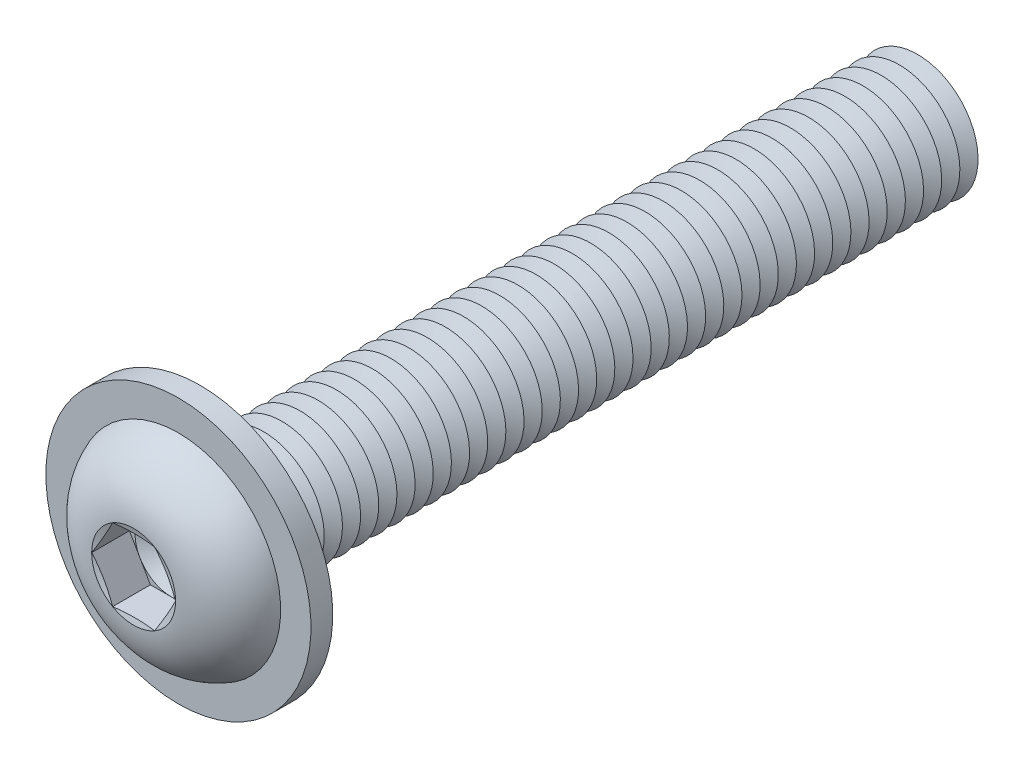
ISO-10303-21;
HEADER;
FILE_DESCRIPTION(('STEP AP214'),'2;1');
FILE_NAME('part.step','',(''),(''),'','','');
FILE_SCHEMA(('AUTOMOTIVE_DESIGN { 1 0 10303 214 1 1 1 1 }'));
ENDSEC;
DATA;
#1=APPLICATION_CONTEXT('core data for automotive mechanical design processes');
#2=APPLICATION_PROTOCOL_DEFINITION('international standard','automotive_design',2000,#1);
#3=PRODUCT_CONTEXT('',#1,'mechanical');
#4=PRODUCT('Part','Part','',(#3));
#5=PRODUCT_RELATED_PRODUCT_CATEGORY('part','',(#4));
#6=PRODUCT_DEFINITION_FORMATION('','',#4);
#7=PRODUCT_DEFINITION_CONTEXT('part definition',#1,'design');
#8=PRODUCT_DEFINITION('design','',#6,#7);
#9=PRODUCT_DEFINITION_SHAPE('','',#8);
#10=(LENGTH_UNIT() NAMED_UNIT(*) SI_UNIT(.MILLI.,.METRE.));
#11=(NAMED_UNIT(*) PLANE_ANGLE_UNIT() SI_UNIT($,.RADIAN.));
#12=(NAMED_UNIT(*) SI_UNIT($,.STERADIAN.) SOLID_ANGLE_UNIT());
#13=UNCERTAINTY_MEASURE_WITH_UNIT(LENGTH_MEASURE(1.E-05),#10,'distance_accuracy_value','');
#14=(GEOMETRIC_REPRESENTATION_CONTEXT(3) GLOBAL_UNCERTAINTY_ASSIGNED_CONTEXT((#13)) GLOBAL_UNIT_ASSIGNED_CONTEXT((#10,
#11,#12)) REPRESENTATION_CONTEXT('',''));
#15=CARTESIAN_POINT('',(0.,0.,0.));
#16=DIRECTION('',(0.,0.,1.));
#17=DIRECTION('',(1.,0.,0.));
#18=AXIS2_PLACEMENT_3D('',#15,#16,#17);
#19=CARTESIAN_POINT('',(0.,0.,-54.75));
#20=DIRECTION('',(0.,0.,1.));
#21=DIRECTION('',(0.,-1.,0.));
#22=AXIS2_PLACEMENT_3D('',#19,#20,#21);
#23=CONICAL_SURFACE('',#22,4.99999999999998,1.0471975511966);
#24=CARTESIAN_POINT('',(0.,0.,-55.5));
#25=DIRECTION('',(0.,0.,1.));
#26=DIRECTION('',(0.,-1.,0.));
#27=AXIS2_PLACEMENT_3D('',#24,#25,#26);
#28=CIRCLE('',#27,3.70096189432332);
#29=CARTESIAN_POINT('',(0.,-3.70096189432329,-55.5));
#30=VERTEX_POINT('',#29);
#31=EDGE_CURVE('E533',#30,#30,#28,.T.);
#32=ORIENTED_EDGE('',*,*,#31,.T.);
#33=EDGE_LOOP('',(#32));
#34=FACE_BOUND('',#33,.T.);
#35=CARTESIAN_POINT('',(0.,0.,-54.75));
#36=DIRECTION('',(0.,0.,1.));
#37=DIRECTION('',(0.,-1.,0.));
#38=AXIS2_PLACEMENT_3D('',#35,#36,#37);
#39=CIRCLE('',#38,4.99999999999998);
#40=CARTESIAN_POINT('',(0.,-4.99999999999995,-54.75));
#41=VERTEX_POINT('',#40);
#42=EDGE_CURVE('E531',#41,#41,#39,.T.);
#43=ORIENTED_EDGE('',*,*,#42,.F.);
#44=EDGE_LOOP('',(#43));
#45=FACE_BOUND('',#44,.T.);
#46=ADVANCED_FACE('F39',(#34,#45),#23,.T.);
#47=CARTESIAN_POINT('',(0.,0.,-55.5));
#48=DIRECTION('',(0.,0.,-1.));
#49=DIRECTION('',(0.,1.,0.));
#50=AXIS2_PLACEMENT_3D('',#47,#48,#49);
#51=CONICAL_SURFACE('',#50,3.70096189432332,1.0471975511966);
#52=CARTESIAN_POINT('',(0.,0.,-56.25));
#53=DIRECTION('',(0.,0.,1.));
#54=DIRECTION('',(0.,-1.,0.));
#55=AXIS2_PLACEMENT_3D('',#52,#53,#54);
#56=CIRCLE('',#55,4.99999999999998);
#57=CARTESIAN_POINT('',(0.,-4.99999999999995,-56.25));
#58=VERTEX_POINT('',#57);
#59=EDGE_CURVE('E475',#58,#58,#56,.T.);
#60=ORIENTED_EDGE('',*,*,#59,.T.);
#61=EDGE_LOOP('',(#60));
#62=FACE_BOUND('',#61,.T.);
#63=ORIENTED_EDGE('',*,*,#31,.F.);
#64=EDGE_LOOP('',(#63));
#65=FACE_BOUND('',#64,.T.);
#66=ADVANCED_FACE('F635',(#62,#65),#51,.T.);
#67=CARTESIAN_POINT('',(0.,4.99999999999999,-60.));
#68=DIRECTION('',(0.,0.,-1.));
#69=DIRECTION('',(0.,1.,0.));
#70=AXIS2_PLACEMENT_3D('',#67,#68,#69);
#71=PLANE('',#70);
#72=CARTESIAN_POINT('',(0.,0.,-60.));
#73=DIRECTION('',(0.,0.,1.));
#74=DIRECTION('',(0.,-1.,0.));
#75=AXIS2_PLACEMENT_3D('',#72,#73,#74);
#76=CIRCLE('',#75,3.70096189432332);
#77=CARTESIAN_POINT('',(0.,-3.70096189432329,-60.));
#78=VERTEX_POINT('',#77);
#79=EDGE_CURVE('E296',#78,#78,#76,.T.);
#80=ORIENTED_EDGE('',*,*,#79,.F.);
#81=EDGE_LOOP('',(#80));
#82=FACE_BOUND('',#81,.T.);
#83=ADVANCED_FACE('F641',(#82),#71,.T.);
#84=CARTESIAN_POINT('',(0.,0.,-59.25));
#85=DIRECTION('',(0.,0.,1.));
#86=DIRECTION('',(0.,-1.,0.));
#87=AXIS2_PLACEMENT_3D('',#84,#85,#86);
#88=CONICAL_SURFACE('',#87,4.99999999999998,1.0471975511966);
#89=ORIENTED_EDGE('',*,*,#79,.T.);
#90=EDGE_LOOP('',(#89));
#91=FACE_BOUND('',#90,.T.);
#92=CARTESIAN_POINT('',(0.,0.,-59.25));
#93=DIRECTION('',(0.,0.,1.));
#94=DIRECTION('',(0.,-1.,0.));
#95=AXIS2_PLACEMENT_3D('',#92,#93,#94);
#96=CIRCLE('',#95,4.99999999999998);
#97=CARTESIAN_POINT('',(0.,-4.99999999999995,-59.25));
#98=VERTEX_POINT('',#97);
#99=EDGE_CURVE('E409',#98,#98,#96,.T.);
#100=ORIENTED_EDGE('',*,*,#99,.F.);
#101=EDGE_LOOP('',(#100));
#102=FACE_BOUND('',#101,.T.);
#103=ADVANCED_FACE('F630',(#91,#102),#88,.T.);
#104=CARTESIAN_POINT('',(0.,0.,-58.5));
#105=DIRECTION('',(0.,0.,-1.));
#106=DIRECTION('',(0.,1.,0.));
#107=AXIS2_PLACEMENT_3D('',#104,#105,#106);
#108=CONICAL_SURFACE('',#107,3.70096189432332,1.0471975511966);
#109=ORIENTED_EDGE('',*,*,#99,.T.);
#110=EDGE_LOOP('',(#109));
#111=FACE_BOUND('',#110,.T.);
#112=CARTESIAN_POINT('',(0.,0.,-58.5));
#113=DIRECTION('',(0.,0.,1.));
#114=DIRECTION('',(0.,-1.,0.));
#115=AXIS2_PLACEMENT_3D('',#112,#113,#114);
#116=CIRCLE('',#115,3.70096189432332);
#117=CARTESIAN_POINT('',(0.,-3.70096189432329,-58.5));
#118=VERTEX_POINT('',#117);
#119=EDGE_CURVE('E411',#118,#118,#116,.T.);
#120=ORIENTED_EDGE('',*,*,#119,.F.);
#121=EDGE_LOOP('',(#120));
#122=FACE_BOUND('',#121,.T.);
#123=ADVANCED_FACE('F621',(#111,#122),#108,.T.);
#124=CARTESIAN_POINT('',(0.,0.,-57.75));
#125=DIRECTION('',(0.,0.,1.));
#126=DIRECTION('',(0.,-1.,0.));
#127=AXIS2_PLACEMENT_3D('',#124,#125,#126);
#128=CONICAL_SURFACE('',#127,4.99999999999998,1.0471975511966);
#129=ORIENTED_EDGE('',*,*,#119,.T.);
#130=EDGE_LOOP('',(#129));
#131=FACE_BOUND('',#130,.T.);
#132=CARTESIAN_POINT('',(0.,0.,-57.75));
#133=DIRECTION('',(0.,0.,1.));
#134=DIRECTION('',(0.,-1.,0.));
#135=AXIS2_PLACEMENT_3D('',#132,#133,#134);
#136=CIRCLE('',#135,4.99999999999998);
#137=CARTESIAN_POINT('',(0.,-4.99999999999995,-57.75));
#138=VERTEX_POINT('',#137);
#139=EDGE_CURVE('E474',#138,#138,#136,.T.);
#140=ORIENTED_EDGE('',*,*,#139,.F.);
#141=EDGE_LOOP('',(#140));
#142=FACE_BOUND('',#141,.T.);
#143=ADVANCED_FACE('F619',(#131,#142),#128,.T.);
#144=CARTESIAN_POINT('',(0.,0.,-57.));
#145=DIRECTION('',(0.,0.,-1.));
#146=DIRECTION('',(0.,1.,0.));
#147=AXIS2_PLACEMENT_3D('',#144,#145,#146);
#148=CONICAL_SURFACE('',#147,3.70096189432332,1.0471975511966);
#149=ORIENTED_EDGE('',*,*,#139,.T.);
#150=EDGE_LOOP('',(#149));
#151=FACE_BOUND('',#150,.T.);
#152=CARTESIAN_POINT('',(0.,0.,-57.));
#153=DIRECTION('',(0.,0.,1.));
#154=DIRECTION('',(0.,-1.,0.));
#155=AXIS2_PLACEMENT_3D('',#152,#153,#154);
#156=CIRCLE('',#155,3.70096189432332);
#157=CARTESIAN_POINT('',(0.,-3.70096189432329,-57.));
#158=VERTEX_POINT('',#157);
#159=EDGE_CURVE('E472',#158,#158,#156,.T.);
#160=ORIENTED_EDGE('',*,*,#159,.F.);
#161=EDGE_LOOP('',(#160));
#162=FACE_BOUND('',#161,.T.);
#163=ADVANCED_FACE('F616',(#151,#162),#148,.T.);
#164=CARTESIAN_POINT('',(0.,0.,-56.25));
#165=DIRECTION('',(0.,0.,1.));
#166=DIRECTION('',(0.,-1.,0.));
#167=AXIS2_PLACEMENT_3D('',#164,#165,#166);
#168=CONICAL_SURFACE('',#167,4.99999999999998,1.0471975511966);
#169=ORIENTED_EDGE('',*,*,#159,.T.);
#170=EDGE_LOOP('',(#169));
#171=FACE_BOUND('',#170,.T.);
#172=ORIENTED_EDGE('',*,*,#59,.F.);
#173=EDGE_LOOP('',(#172));
#174=FACE_BOUND('',#173,.T.);
#175=ADVANCED_FACE('F628',(#171,#174),#168,.T.);
#176=CARTESIAN_POINT('',(0.,0.,-53.25));
#177=DIRECTION('',(0.,0.,1.));
#178=DIRECTION('',(0.,-1.,0.));
#179=AXIS2_PLACEMENT_3D('',#176,#177,#178);
#180=CONICAL_SURFACE('',#179,4.99999999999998,1.0471975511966);
#181=CARTESIAN_POINT('',(0.,0.,-54.));
#182=DIRECTION('',(0.,0.,1.));
#183=DIRECTION('',(0.,-1.,0.));
#184=AXIS2_PLACEMENT_3D('',#181,#182,#183);
#185=CIRCLE('',#184,3.70096189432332);
#186=CARTESIAN_POINT('',(0.,-3.70096189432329,-54.));
#187=VERTEX_POINT('',#186);
#188=EDGE_CURVE('E518',#187,#187,#185,.T.);
#189=ORIENTED_EDGE('',*,*,#188,.T.);
#190=EDGE_LOOP('',(#189));
#191=FACE_BOUND('',#190,.T.);
#192=CARTESIAN_POINT('',(0.,0.,-53.25));
#193=DIRECTION('',(0.,0.,1.));
#194=DIRECTION('',(0.,-1.,0.));
#195=AXIS2_PLACEMENT_3D('',#192,#193,#194);
#196=CIRCLE('',#195,4.99999999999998);
#197=CARTESIAN_POINT('',(0.,-4.99999999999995,-53.25));
#198=VERTEX_POINT('',#197);
#199=EDGE_CURVE('E516',#198,#198,#196,.T.);
#200=ORIENTED_EDGE('',*,*,#199,.F.);
#201=EDGE_LOOP('',(#200));
#202=FACE_BOUND('',#201,.T.);
#203=ADVANCED_FACE('F648',(#191,#202),#180,.T.);
#204=CARTESIAN_POINT('',(0.,0.,-54.));
#205=DIRECTION('',(0.,0.,-1.));
#206=DIRECTION('',(0.,1.,0.));
#207=AXIS2_PLACEMENT_3D('',#204,#205,#206);
#208=CONICAL_SURFACE('',#207,3.70096189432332,1.0471975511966);
#209=ORIENTED_EDGE('',*,*,#42,.T.);
#210=EDGE_LOOP('',(#209));
#211=FACE_BOUND('',#210,.T.);
#212=ORIENTED_EDGE('',*,*,#188,.F.);
#213=EDGE_LOOP('',(#212));
#214=FACE_BOUND('',#213,.T.);
#215=ADVANCED_FACE('F653',(#211,#214),#208,.T.);
#216=CARTESIAN_POINT('',(0.,0.,-51.75));
#217=DIRECTION('',(0.,0.,1.));
#218=DIRECTION('',(0.,-1.,0.));
#219=AXIS2_PLACEMENT_3D('',#216,#217,#218);
#220=CONICAL_SURFACE('',#219,4.99999999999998,1.0471975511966);
#221=CARTESIAN_POINT('',(0.,0.,-52.5));
#222=DIRECTION('',(0.,0.,1.));
#223=DIRECTION('',(0.,-1.,0.));
#224=AXIS2_PLACEMENT_3D('',#221,#222,#223);
#225=CIRCLE('',#224,3.70096189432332);
#226=CARTESIAN_POINT('',(0.,-3.70096189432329,-52.5));
#227=VERTEX_POINT('',#226);
#228=EDGE_CURVE('E519',#227,#227,#225,.T.);
#229=ORIENTED_EDGE('',*,*,#228,.T.);
#230=EDGE_LOOP('',(#229));
#231=FACE_BOUND('',#230,.T.);
#232=CARTESIAN_POINT('',(0.,0.,-51.75));
#233=DIRECTION('',(0.,0.,1.));
#234=DIRECTION('',(0.,-1.,0.));
#235=AXIS2_PLACEMENT_3D('',#232,#233,#234);
#236=CIRCLE('',#235,4.99999999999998);
#237=CARTESIAN_POINT('',(0.,-4.99999999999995,-51.75));
#238=VERTEX_POINT('',#237);
#239=EDGE_CURVE('E455',#238,#238,#236,.T.);
#240=ORIENTED_EDGE('',*,*,#239,.F.);
#241=EDGE_LOOP('',(#240));
#242=FACE_BOUND('',#241,.T.);
#243=ADVANCED_FACE('F663',(#231,#242),#220,.T.);
#244=CARTESIAN_POINT('',(0.,0.,-52.5));
#245=DIRECTION('',(0.,0.,-1.));
#246=DIRECTION('',(0.,1.,0.));
#247=AXIS2_PLACEMENT_3D('',#244,#245,#246);
#248=CONICAL_SURFACE('',#247,3.70096189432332,1.0471975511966);
#249=ORIENTED_EDGE('',*,*,#199,.T.);
#250=EDGE_LOOP('',(#249));
#251=FACE_BOUND('',#250,.T.);
#252=ORIENTED_EDGE('',*,*,#228,.F.);
#253=EDGE_LOOP('',(#252));
#254=FACE_BOUND('',#253,.T.);
#255=ADVANCED_FACE('F669',(#251,#254),#248,.T.);
#256=CARTESIAN_POINT('',(0.,0.,-50.25));
#257=DIRECTION('',(0.,0.,1.));
#258=DIRECTION('',(0.,-1.,0.));
#259=AXIS2_PLACEMENT_3D('',#256,#257,#258);
#260=CONICAL_SURFACE('',#259,4.99999999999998,1.0471975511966);
#261=CARTESIAN_POINT('',(0.,0.,-51.));
#262=DIRECTION('',(0.,0.,1.));
#263=DIRECTION('',(0.,-1.,0.));
#264=AXIS2_PLACEMENT_3D('',#261,#262,#263);
#265=CIRCLE('',#264,3.70096189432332);
#266=CARTESIAN_POINT('',(0.,-3.70096189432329,-51.));
#267=VERTEX_POINT('',#266);
#268=EDGE_CURVE('E453',#267,#267,#265,.T.);
#269=ORIENTED_EDGE('',*,*,#268,.T.);
#270=EDGE_LOOP('',(#269));
#271=FACE_BOUND('',#270,.T.);
#272=CARTESIAN_POINT('',(0.,0.,-50.25));
#273=DIRECTION('',(0.,0.,1.));
#274=DIRECTION('',(0.,-1.,0.));
#275=AXIS2_PLACEMENT_3D('',#272,#273,#274);
#276=CIRCLE('',#275,4.99999999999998);
#277=CARTESIAN_POINT('',(0.,-4.99999999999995,-50.25));
#278=VERTEX_POINT('',#277);
#279=EDGE_CURVE('E456',#278,#278,#276,.T.);
#280=ORIENTED_EDGE('',*,*,#279,.F.);
#281=EDGE_LOOP('',(#280));
#282=FACE_BOUND('',#281,.T.);
#283=ADVANCED_FACE('F673',(#271,#282),#260,.T.);
#284=CARTESIAN_POINT('',(0.,0.,-51.));
#285=DIRECTION('',(0.,0.,-1.));
#286=DIRECTION('',(0.,1.,0.));
#287=AXIS2_PLACEMENT_3D('',#284,#285,#286);
#288=CONICAL_SURFACE('',#287,3.70096189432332,1.0471975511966);
#289=ORIENTED_EDGE('',*,*,#239,.T.);
#290=EDGE_LOOP('',(#289));
#291=FACE_BOUND('',#290,.T.);
#292=ORIENTED_EDGE('',*,*,#268,.F.);
#293=EDGE_LOOP('',(#292));
#294=FACE_BOUND('',#293,.T.);
#295=ADVANCED_FACE('F677',(#291,#294),#288,.T.);
#296=CARTESIAN_POINT('',(0.,0.,-48.75));
#297=DIRECTION('',(0.,0.,1.));
#298=DIRECTION('',(0.,-1.,0.));
#299=AXIS2_PLACEMENT_3D('',#296,#297,#298);
#300=CONICAL_SURFACE('',#299,4.99999999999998,1.0471975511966);
#301=CARTESIAN_POINT('',(0.,0.,-49.5));
#302=DIRECTION('',(0.,0.,1.));
#303=DIRECTION('',(0.,-1.,0.));
#304=AXIS2_PLACEMENT_3D('',#301,#302,#303);
#305=CIRCLE('',#304,3.70096189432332);
#306=CARTESIAN_POINT('',(0.,-3.70096189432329,-49.5));
#307=VERTEX_POINT('',#306);
#308=EDGE_CURVE('E549',#307,#307,#305,.T.);
#309=ORIENTED_EDGE('',*,*,#308,.T.);
#310=EDGE_LOOP('',(#309));
#311=FACE_BOUND('',#310,.T.);
#312=CARTESIAN_POINT('',(0.,0.,-48.75));
#313=DIRECTION('',(0.,0.,1.));
#314=DIRECTION('',(0.,-1.,0.));
#315=AXIS2_PLACEMENT_3D('',#312,#313,#314);
#316=CIRCLE('',#315,4.99999999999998);
#317=CARTESIAN_POINT('',(0.,-4.99999999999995,-48.75));
#318=VERTEX_POINT('',#317);
#319=EDGE_CURVE('E546',#318,#318,#316,.T.);
#320=ORIENTED_EDGE('',*,*,#319,.F.);
#321=EDGE_LOOP('',(#320));
#322=FACE_BOUND('',#321,.T.);
#323=ADVANCED_FACE('F681',(#311,#322),#300,.T.);
#324=CARTESIAN_POINT('',(0.,0.,-49.5));
#325=DIRECTION('',(0.,0.,-1.));
#326=DIRECTION('',(0.,1.,0.));
#327=AXIS2_PLACEMENT_3D('',#324,#325,#326);
#328=CONICAL_SURFACE('',#327,3.70096189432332,1.0471975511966);
#329=ORIENTED_EDGE('',*,*,#279,.T.);
#330=EDGE_LOOP('',(#329));
#331=FACE_BOUND('',#330,.T.);
#332=ORIENTED_EDGE('',*,*,#308,.F.);
#333=EDGE_LOOP('',(#332));
#334=FACE_BOUND('',#333,.T.);
#335=ADVANCED_FACE('F685',(#331,#334),#328,.T.);
#336=CARTESIAN_POINT('',(0.,0.,-47.25));
#337=DIRECTION('',(0.,0.,1.));
#338=DIRECTION('',(0.,-1.,0.));
#339=AXIS2_PLACEMENT_3D('',#336,#337,#338);
#340=CONICAL_SURFACE('',#339,4.99999999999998,1.0471975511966);
#341=CARTESIAN_POINT('',(0.,0.,-48.));
#342=DIRECTION('',(0.,0.,1.));
#343=DIRECTION('',(0.,-1.,0.));
#344=AXIS2_PLACEMENT_3D('',#341,#342,#343);
#345=CIRCLE('',#344,3.70096189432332);
#346=CARTESIAN_POINT('',(0.,-3.70096189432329,-48.));
#347=VERTEX_POINT('',#346);
#348=EDGE_CURVE('E550',#347,#347,#345,.T.);
#349=ORIENTED_EDGE('',*,*,#348,.T.);
#350=EDGE_LOOP('',(#349));
#351=FACE_BOUND('',#350,.T.);
#352=CARTESIAN_POINT('',(0.,0.,-47.25));
#353=DIRECTION('',(0.,0.,1.));
#354=DIRECTION('',(0.,-1.,0.));
#355=AXIS2_PLACEMENT_3D('',#352,#353,#354);
#356=CIRCLE('',#355,4.99999999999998);
#357=CARTESIAN_POINT('',(0.,-4.99999999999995,-47.25));
#358=VERTEX_POINT('',#357);
#359=EDGE_CURVE('E1713',#358,#358,#356,.T.);
#360=ORIENTED_EDGE('',*,*,#359,.F.);
#361=EDGE_LOOP('',(#360));
#362=FACE_BOUND('',#361,.T.);
#363=ADVANCED_FACE('F689',(#351,#362),#340,.T.);
#364=CARTESIAN_POINT('',(0.,0.,-48.));
#365=DIRECTION('',(0.,0.,-1.));
#366=DIRECTION('',(0.,1.,0.));
#367=AXIS2_PLACEMENT_3D('',#364,#365,#366);
#368=CONICAL_SURFACE('',#367,3.70096189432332,1.0471975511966);
#369=ORIENTED_EDGE('',*,*,#319,.T.);
#370=EDGE_LOOP('',(#369));
#371=FACE_BOUND('',#370,.T.);
#372=ORIENTED_EDGE('',*,*,#348,.F.);
#373=EDGE_LOOP('',(#372));
#374=FACE_BOUND('',#373,.T.);
#375=ADVANCED_FACE('F693',(#371,#374),#368,.T.);
#376=CARTESIAN_POINT('',(0.,0.,-45.75));
#377=DIRECTION('',(0.,0.,1.));
#378=DIRECTION('',(0.,-1.,0.));
#379=AXIS2_PLACEMENT_3D('',#376,#377,#378);
#380=CONICAL_SURFACE('',#379,4.99999999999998,1.0471975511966);
#381=CARTESIAN_POINT('',(0.,0.,-46.5));
#382=DIRECTION('',(0.,0.,1.));
#383=DIRECTION('',(0.,-1.,0.));
#384=AXIS2_PLACEMENT_3D('',#381,#382,#383);
#385=CIRCLE('',#384,3.70096189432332);
#386=CARTESIAN_POINT('',(0.,-3.70096189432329,-46.5));
#387=VERTEX_POINT('',#386);
#388=EDGE_CURVE('E451',#387,#387,#385,.T.);
#389=ORIENTED_EDGE('',*,*,#388,.T.);
#390=EDGE_LOOP('',(#389));
#391=FACE_BOUND('',#390,.T.);
#392=CARTESIAN_POINT('',(0.,0.,-45.75));
#393=DIRECTION('',(0.,0.,1.));
#394=DIRECTION('',(0.,-1.,0.));
#395=AXIS2_PLACEMENT_3D('',#392,#393,#394);
#396=CIRCLE('',#395,4.99999999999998);
#397=CARTESIAN_POINT('',(0.,-4.99999999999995,-45.75));
#398=VERTEX_POINT('',#397);
#399=EDGE_CURVE('E350',#398,#398,#396,.T.);
#400=ORIENTED_EDGE('',*,*,#399,.F.);
#401=EDGE_LOOP('',(#400));
#402=FACE_BOUND('',#401,.T.);
#403=ADVANCED_FACE('F697',(#391,#402),#380,.T.);
#404=CARTESIAN_POINT('',(0.,0.,-46.5));
#405=DIRECTION('',(0.,0.,-1.));
#406=DIRECTION('',(0.,1.,0.));
#407=AXIS2_PLACEMENT_3D('',#404,#405,#406);
#408=CONICAL_SURFACE('',#407,3.70096189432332,1.0471975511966);
#409=ORIENTED_EDGE('',*,*,#359,.T.);
#410=EDGE_LOOP('',(#409));
#411=FACE_BOUND('',#410,.T.);
#412=ORIENTED_EDGE('',*,*,#388,.F.);
#413=EDGE_LOOP('',(#412));
#414=FACE_BOUND('',#413,.T.);
#415=ADVANCED_FACE('F701',(#411,#414),#408,.T.);
#416=CARTESIAN_POINT('',(0.,0.,-44.25));
#417=DIRECTION('',(0.,0.,1.));
#418=DIRECTION('',(0.,-1.,0.));
#419=AXIS2_PLACEMENT_3D('',#416,#417,#418);
#420=CONICAL_SURFACE('',#419,4.99999999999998,1.0471975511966);
#421=CARTESIAN_POINT('',(0.,0.,-45.));
#422=DIRECTION('',(0.,0.,1.));
#423=DIRECTION('',(0.,-1.,0.));
#424=AXIS2_PLACEMENT_3D('',#421,#422,#423);
#425=CIRCLE('',#424,3.70096189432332);
#426=CARTESIAN_POINT('',(0.,-3.7009618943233,-45.));
#427=VERTEX_POINT('',#426);
#428=EDGE_CURVE('E348',#427,#427,#425,.T.);
#429=ORIENTED_EDGE('',*,*,#428,.T.);
#430=EDGE_LOOP('',(#429));
#431=FACE_BOUND('',#430,.T.);
#432=CARTESIAN_POINT('',(0.,0.,-44.25));
#433=DIRECTION('',(0.,0.,1.));
#434=DIRECTION('',(0.,-1.,0.));
#435=AXIS2_PLACEMENT_3D('',#432,#433,#434);
#436=CIRCLE('',#435,4.99999999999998);
#437=CARTESIAN_POINT('',(0.,-4.99999999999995,-44.25));
#438=VERTEX_POINT('',#437);
#439=EDGE_CURVE('E351',#438,#438,#436,.T.);
#440=ORIENTED_EDGE('',*,*,#439,.F.);
#441=EDGE_LOOP('',(#440));
#442=FACE_BOUND('',#441,.T.);
#443=ADVANCED_FACE('F705',(#431,#442),#420,.T.);
#444=CARTESIAN_POINT('',(0.,0.,-45.));
#445=DIRECTION('',(0.,0.,-1.));
#446=DIRECTION('',(0.,1.,0.));
#447=AXIS2_PLACEMENT_3D('',#444,#445,#446);
#448=CONICAL_SURFACE('',#447,3.70096189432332,1.0471975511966);
#449=ORIENTED_EDGE('',*,*,#399,.T.);
#450=EDGE_LOOP('',(#449));
#451=FACE_BOUND('',#450,.T.);
#452=ORIENTED_EDGE('',*,*,#428,.F.);
#453=EDGE_LOOP('',(#452));
#454=FACE_BOUND('',#453,.T.);
#455=ADVANCED_FACE('F709',(#451,#454),#448,.T.);
#456=CARTESIAN_POINT('',(0.,0.,-42.75));
#457=DIRECTION('',(0.,0.,1.));
#458=DIRECTION('',(0.,-1.,0.));
#459=AXIS2_PLACEMENT_3D('',#456,#457,#458);
#460=CONICAL_SURFACE('',#459,4.99999999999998,1.0471975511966);
#461=CARTESIAN_POINT('',(0.,0.,-43.5));
#462=DIRECTION('',(0.,0.,1.));
#463=DIRECTION('',(0.,-1.,0.));
#464=AXIS2_PLACEMENT_3D('',#461,#462,#463);
#465=CIRCLE('',#464,3.70096189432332);
#466=CARTESIAN_POINT('',(0.,-3.7009618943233,-43.5));
#467=VERTEX_POINT('',#466);
#468=EDGE_CURVE('E377',#467,#467,#465,.T.);
#469=ORIENTED_EDGE('',*,*,#468,.T.);
#470=EDGE_LOOP('',(#469));
#471=FACE_BOUND('',#470,.T.);
#472=CARTESIAN_POINT('',(0.,0.,-42.75));
#473=DIRECTION('',(0.,0.,1.));
#474=DIRECTION('',(0.,-1.,0.));
#475=AXIS2_PLACEMENT_3D('',#472,#473,#474);
#476=CIRCLE('',#475,4.99999999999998);
#477=CARTESIAN_POINT('',(0.,-4.99999999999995,-42.75));
#478=VERTEX_POINT('',#477);
#479=EDGE_CURVE('E379',#478,#478,#476,.T.);
#480=ORIENTED_EDGE('',*,*,#479,.F.);
#481=EDGE_LOOP('',(#480));
#482=FACE_BOUND('',#481,.T.);
#483=ADVANCED_FACE('F713',(#471,#482),#460,.T.);
#484=CARTESIAN_POINT('',(0.,0.,-43.5));
#485=DIRECTION('',(0.,0.,-1.));
#486=DIRECTION('',(0.,1.,0.));
#487=AXIS2_PLACEMENT_3D('',#484,#485,#486);
#488=CONICAL_SURFACE('',#487,3.70096189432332,1.0471975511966);
#489=ORIENTED_EDGE('',*,*,#439,.T.);
#490=EDGE_LOOP('',(#489));
#491=FACE_BOUND('',#490,.T.);
#492=ORIENTED_EDGE('',*,*,#468,.F.);
#493=EDGE_LOOP('',(#492));
#494=FACE_BOUND('',#493,.T.);
#495=ADVANCED_FACE('F717',(#491,#494),#488,.T.);
#496=CARTESIAN_POINT('',(0.,0.,-41.25));
#497=DIRECTION('',(0.,0.,1.));
#498=DIRECTION('',(0.,-1.,0.));
#499=AXIS2_PLACEMENT_3D('',#496,#497,#498);
#500=CONICAL_SURFACE('',#499,4.99999999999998,1.0471975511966);
#501=CARTESIAN_POINT('',(0.,0.,-42.));
#502=DIRECTION('',(0.,0.,1.));
#503=DIRECTION('',(0.,-1.,0.));
#504=AXIS2_PLACEMENT_3D('',#501,#502,#503);
#505=CIRCLE('',#504,3.70096189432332);
#506=CARTESIAN_POINT('',(0.,-3.7009618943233,-42.));
#507=VERTEX_POINT('',#506);
#508=EDGE_CURVE('E345',#507,#507,#505,.T.);
#509=ORIENTED_EDGE('',*,*,#508,.T.);
#510=EDGE_LOOP('',(#509));
#511=FACE_BOUND('',#510,.T.);
#512=CARTESIAN_POINT('',(0.,0.,-41.25));
#513=DIRECTION('',(0.,0.,1.));
#514=DIRECTION('',(0.,-1.,0.));
#515=AXIS2_PLACEMENT_3D('',#512,#513,#514);
#516=CIRCLE('',#515,4.99999999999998);
#517=CARTESIAN_POINT('',(0.,-4.99999999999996,-41.25));
#518=VERTEX_POINT('',#517);
#519=EDGE_CURVE('E342',#518,#518,#516,.T.);
#520=ORIENTED_EDGE('',*,*,#519,.F.);
#521=EDGE_LOOP('',(#520));
#522=FACE_BOUND('',#521,.T.);
#523=ADVANCED_FACE('F721',(#511,#522),#500,.T.);
#524=CARTESIAN_POINT('',(0.,0.,-42.));
#525=DIRECTION('',(0.,0.,-1.));
#526=DIRECTION('',(0.,1.,0.));
#527=AXIS2_PLACEMENT_3D('',#524,#525,#526);
#528=CONICAL_SURFACE('',#527,3.70096189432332,1.0471975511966);
#529=ORIENTED_EDGE('',*,*,#479,.T.);
#530=EDGE_LOOP('',(#529));
#531=FACE_BOUND('',#530,.T.);
#532=ORIENTED_EDGE('',*,*,#508,.F.);
#533=EDGE_LOOP('',(#532));
#534=FACE_BOUND('',#533,.T.);
#535=ADVANCED_FACE('F725',(#531,#534),#528,.T.);
#536=CARTESIAN_POINT('',(0.,0.,-39.75));
#537=DIRECTION('',(0.,0.,1.));
#538=DIRECTION('',(0.,-1.,0.));
#539=AXIS2_PLACEMENT_3D('',#536,#537,#538);
#540=CONICAL_SURFACE('',#539,4.99999999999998,1.0471975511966);
#541=CARTESIAN_POINT('',(0.,0.,-40.5));
#542=DIRECTION('',(0.,0.,1.));
#543=DIRECTION('',(0.,-1.,0.));
#544=AXIS2_PLACEMENT_3D('',#541,#542,#543);
#545=CIRCLE('',#544,3.70096189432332);
#546=CARTESIAN_POINT('',(0.,-3.7009618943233,-40.5));
#547=VERTEX_POINT('',#546);
#548=EDGE_CURVE('E346',#547,#547,#545,.T.);
#549=ORIENTED_EDGE('',*,*,#548,.T.);
#550=EDGE_LOOP('',(#549));
#551=FACE_BOUND('',#550,.T.);
#552=CARTESIAN_POINT('',(0.,0.,-39.75));
#553=DIRECTION('',(0.,0.,1.));
#554=DIRECTION('',(0.,-1.,0.));
#555=AXIS2_PLACEMENT_3D('',#552,#553,#554);
#556=CIRCLE('',#555,4.99999999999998);
#557=CARTESIAN_POINT('',(0.,-4.99999999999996,-39.75));
#558=VERTEX_POINT('',#557);
#559=EDGE_CURVE('E430',#558,#558,#556,.T.);
#560=ORIENTED_EDGE('',*,*,#559,.F.);
#561=EDGE_LOOP('',(#560));
#562=FACE_BOUND('',#561,.T.);
#563=ADVANCED_FACE('F729',(#551,#562),#540,.T.);
#564=CARTESIAN_POINT('',(0.,0.,-40.5));
#565=DIRECTION('',(0.,0.,-1.));
#566=DIRECTION('',(0.,1.,0.));
#567=AXIS2_PLACEMENT_3D('',#564,#565,#566);
#568=CONICAL_SURFACE('',#567,3.70096189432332,1.0471975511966);
#569=ORIENTED_EDGE('',*,*,#519,.T.);
#570=EDGE_LOOP('',(#569));
#571=FACE_BOUND('',#570,.T.);
#572=ORIENTED_EDGE('',*,*,#548,.F.);
#573=EDGE_LOOP('',(#572));
#574=FACE_BOUND('',#573,.T.);
#575=ADVANCED_FACE('F733',(#571,#574),#568,.T.);
#576=CARTESIAN_POINT('',(0.,0.,-38.25));
#577=DIRECTION('',(0.,0.,1.));
#578=DIRECTION('',(0.,-1.,0.));
#579=AXIS2_PLACEMENT_3D('',#576,#577,#578);
#580=CONICAL_SURFACE('',#579,4.99999999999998,1.0471975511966);
#581=CARTESIAN_POINT('',(0.,0.,-39.));
#582=DIRECTION('',(0.,0.,1.));
#583=DIRECTION('',(0.,-1.,0.));
#584=AXIS2_PLACEMENT_3D('',#581,#582,#583);
#585=CIRCLE('',#584,3.70096189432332);
#586=CARTESIAN_POINT('',(0.,-3.7009618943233,-39.));
#587=VERTEX_POINT('',#586);
#588=EDGE_CURVE('E433',#587,#587,#585,.T.);
#589=ORIENTED_EDGE('',*,*,#588,.T.);
#590=EDGE_LOOP('',(#589));
#591=FACE_BOUND('',#590,.T.);
#592=CARTESIAN_POINT('',(0.,0.,-38.25));
#593=DIRECTION('',(0.,0.,1.));
#594=DIRECTION('',(0.,-1.,0.));
#595=AXIS2_PLACEMENT_3D('',#592,#593,#594);
#596=CIRCLE('',#595,4.99999999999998);
#597=CARTESIAN_POINT('',(0.,-4.99999999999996,-38.25));
#598=VERTEX_POINT('',#597);
#599=EDGE_CURVE('E1759',#598,#598,#596,.T.);
#600=ORIENTED_EDGE('',*,*,#599,.F.);
#601=EDGE_LOOP('',(#600));
#602=FACE_BOUND('',#601,.T.);
#603=ADVANCED_FACE('F737',(#591,#602),#580,.T.);
#604=CARTESIAN_POINT('',(0.,0.,-39.));
#605=DIRECTION('',(0.,0.,-1.));
#606=DIRECTION('',(0.,1.,0.));
#607=AXIS2_PLACEMENT_3D('',#604,#605,#606);
#608=CONICAL_SURFACE('',#607,3.70096189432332,1.0471975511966);
#609=ORIENTED_EDGE('',*,*,#559,.T.);
#610=EDGE_LOOP('',(#609));
#611=FACE_BOUND('',#610,.T.);
#612=ORIENTED_EDGE('',*,*,#588,.F.);
#613=EDGE_LOOP('',(#612));
#614=FACE_BOUND('',#613,.T.);
#615=ADVANCED_FACE('F741',(#611,#614),#608,.T.);
#616=CARTESIAN_POINT('',(0.,0.,-36.75));
#617=DIRECTION('',(0.,0.,1.));
#618=DIRECTION('',(0.,-1.,0.));
#619=AXIS2_PLACEMENT_3D('',#616,#617,#618);
#620=CONICAL_SURFACE('',#619,4.99999999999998,1.0471975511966);
#621=CARTESIAN_POINT('',(0.,0.,-37.5));
#622=DIRECTION('',(0.,0.,1.));
#623=DIRECTION('',(0.,-1.,0.));
#624=AXIS2_PLACEMENT_3D('',#621,#622,#623);
#625=CIRCLE('',#624,3.70096189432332);
#626=CARTESIAN_POINT('',(0.,-3.7009618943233,-37.5));
#627=VERTEX_POINT('',#626);
#628=EDGE_CURVE('E511',#627,#627,#625,.T.);
#629=ORIENTED_EDGE('',*,*,#628,.T.);
#630=EDGE_LOOP('',(#629));
#631=FACE_BOUND('',#630,.T.);
#632=CARTESIAN_POINT('',(0.,0.,-36.75));
#633=DIRECTION('',(0.,0.,1.));
#634=DIRECTION('',(0.,-1.,0.));
#635=AXIS2_PLACEMENT_3D('',#632,#633,#634);
#636=CIRCLE('',#635,4.99999999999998);
#637=CARTESIAN_POINT('',(0.,-4.99999999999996,-36.75));
#638=VERTEX_POINT('',#637);
#639=EDGE_CURVE('E470',#638,#638,#636,.T.);
#640=ORIENTED_EDGE('',*,*,#639,.F.);
#641=EDGE_LOOP('',(#640));
#642=FACE_BOUND('',#641,.T.);
#643=ADVANCED_FACE('F745',(#631,#642),#620,.T.);
#644=CARTESIAN_POINT('',(0.,0.,-37.5));
#645=DIRECTION('',(0.,0.,-1.));
#646=DIRECTION('',(0.,1.,0.));
#647=AXIS2_PLACEMENT_3D('',#644,#645,#646);
#648=CONICAL_SURFACE('',#647,3.70096189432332,1.0471975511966);
#649=ORIENTED_EDGE('',*,*,#599,.T.);
#650=EDGE_LOOP('',(#649));
#651=FACE_BOUND('',#650,.T.);
#652=ORIENTED_EDGE('',*,*,#628,.F.);
#653=EDGE_LOOP('',(#652));
#654=FACE_BOUND('',#653,.T.);
#655=ADVANCED_FACE('F749',(#651,#654),#648,.T.);
#656=CARTESIAN_POINT('',(0.,0.,-35.25));
#657=DIRECTION('',(0.,0.,1.));
#658=DIRECTION('',(0.,-1.,0.));
#659=AXIS2_PLACEMENT_3D('',#656,#657,#658);
#660=CONICAL_SURFACE('',#659,4.99999999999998,1.0471975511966);
#661=CARTESIAN_POINT('',(0.,0.,-36.));
#662=DIRECTION('',(0.,0.,1.));
#663=DIRECTION('',(0.,-1.,0.));
#664=AXIS2_PLACEMENT_3D('',#661,#662,#663);
#665=CIRCLE('',#664,3.70096189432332);
#666=CARTESIAN_POINT('',(0.,-3.7009618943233,-36.));
#667=VERTEX_POINT('',#666);
#668=EDGE_CURVE('E467',#667,#667,#665,.T.);
#669=ORIENTED_EDGE('',*,*,#668,.T.);
#670=EDGE_LOOP('',(#669));
#671=FACE_BOUND('',#670,.T.);
#672=CARTESIAN_POINT('',(0.,0.,-35.25));
#673=DIRECTION('',(0.,0.,1.));
#674=DIRECTION('',(0.,-1.,0.));
#675=AXIS2_PLACEMENT_3D('',#672,#673,#674);
#676=CIRCLE('',#675,4.99999999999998);
#677=CARTESIAN_POINT('',(0.,-4.99999999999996,-35.25));
#678=VERTEX_POINT('',#677);
#679=EDGE_CURVE('E446',#678,#678,#676,.T.);
#680=ORIENTED_EDGE('',*,*,#679,.F.);
#681=EDGE_LOOP('',(#680));
#682=FACE_BOUND('',#681,.T.);
#683=ADVANCED_FACE('F753',(#671,#682),#660,.T.);
#684=CARTESIAN_POINT('',(0.,0.,-36.));
#685=DIRECTION('',(0.,0.,-1.));
#686=DIRECTION('',(0.,1.,0.));
#687=AXIS2_PLACEMENT_3D('',#684,#685,#686);
#688=CONICAL_SURFACE('',#687,3.70096189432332,1.0471975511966);
#689=ORIENTED_EDGE('',*,*,#639,.T.);
#690=EDGE_LOOP('',(#689));
#691=FACE_BOUND('',#690,.T.);
#692=ORIENTED_EDGE('',*,*,#668,.F.);
#693=EDGE_LOOP('',(#692));
#694=FACE_BOUND('',#693,.T.);
#695=ADVANCED_FACE('F757',(#691,#694),#688,.T.);
#696=CARTESIAN_POINT('',(0.,0.,-33.75));
#697=DIRECTION('',(0.,0.,1.));
#698=DIRECTION('',(0.,-1.,0.));
#699=AXIS2_PLACEMENT_3D('',#696,#697,#698);
#700=CONICAL_SURFACE('',#699,4.99999999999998,1.0471975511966);
#701=CARTESIAN_POINT('',(0.,0.,-34.5));
#702=DIRECTION('',(0.,0.,1.));
#703=DIRECTION('',(0.,-1.,0.));
#704=AXIS2_PLACEMENT_3D('',#701,#702,#703);
#705=CIRCLE('',#704,3.70096189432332);
#706=CARTESIAN_POINT('',(0.,-3.7009618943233,-34.5));
#707=VERTEX_POINT('',#706);
#708=EDGE_CURVE('E443',#707,#707,#705,.T.);
#709=ORIENTED_EDGE('',*,*,#708,.T.);
#710=EDGE_LOOP('',(#709));
#711=FACE_BOUND('',#710,.T.);
#712=CARTESIAN_POINT('',(0.,0.,-33.75));
#713=DIRECTION('',(0.,0.,1.));
#714=DIRECTION('',(0.,-1.,0.));
#715=AXIS2_PLACEMENT_3D('',#712,#713,#714);
#716=CIRCLE('',#715,4.99999999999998);
#717=CARTESIAN_POINT('',(0.,-4.99999999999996,-33.75));
#718=VERTEX_POINT('',#717);
#719=EDGE_CURVE('E447',#718,#718,#716,.T.);
#720=ORIENTED_EDGE('',*,*,#719,.F.);
#721=EDGE_LOOP('',(#720));
#722=FACE_BOUND('',#721,.T.);
#723=ADVANCED_FACE('F761',(#711,#722),#700,.T.);
#724=CARTESIAN_POINT('',(0.,0.,-34.5));
#725=DIRECTION('',(0.,0.,-1.));
#726=DIRECTION('',(0.,1.,0.));
#727=AXIS2_PLACEMENT_3D('',#724,#725,#726);
#728=CONICAL_SURFACE('',#727,3.70096189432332,1.0471975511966);
#729=ORIENTED_EDGE('',*,*,#679,.T.);
#730=EDGE_LOOP('',(#729));
#731=FACE_BOUND('',#730,.T.);
#732=ORIENTED_EDGE('',*,*,#708,.F.);
#733=EDGE_LOOP('',(#732));
#734=FACE_BOUND('',#733,.T.);
#735=ADVANCED_FACE('F765',(#731,#734),#728,.T.);
#736=CARTESIAN_POINT('',(0.,0.,-32.25));
#737=DIRECTION('',(0.,0.,1.));
#738=DIRECTION('',(0.,-1.,0.));
#739=AXIS2_PLACEMENT_3D('',#736,#737,#738);
#740=CONICAL_SURFACE('',#739,4.99999999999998,1.0471975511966);
#741=CARTESIAN_POINT('',(0.,0.,-33.));
#742=DIRECTION('',(0.,0.,1.));
#743=DIRECTION('',(0.,-1.,0.));
#744=AXIS2_PLACEMENT_3D('',#741,#742,#743);
#745=CIRCLE('',#744,3.70096189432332);
#746=CARTESIAN_POINT('',(0.,-3.7009618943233,-33.));
#747=VERTEX_POINT('',#746);
#748=EDGE_CURVE('E374',#747,#747,#745,.T.);
#749=ORIENTED_EDGE('',*,*,#748,.T.);
#750=EDGE_LOOP('',(#749));
#751=FACE_BOUND('',#750,.T.);
#752=CARTESIAN_POINT('',(0.,0.,-32.25));
#753=DIRECTION('',(0.,0.,1.));
#754=DIRECTION('',(0.,-1.,0.));
#755=AXIS2_PLACEMENT_3D('',#752,#753,#754);
#756=CIRCLE('',#755,4.99999999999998);
#757=CARTESIAN_POINT('',(0.,-4.99999999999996,-32.25));
#758=VERTEX_POINT('',#757);
#759=EDGE_CURVE('E371',#758,#758,#756,.T.);
#760=ORIENTED_EDGE('',*,*,#759,.F.);
#761=EDGE_LOOP('',(#760));
#762=FACE_BOUND('',#761,.T.);
#763=ADVANCED_FACE('F769',(#751,#762),#740,.T.);
#764=CARTESIAN_POINT('',(0.,0.,-33.));
#765=DIRECTION('',(0.,0.,-1.));
#766=DIRECTION('',(0.,1.,0.));
#767=AXIS2_PLACEMENT_3D('',#764,#765,#766);
#768=CONICAL_SURFACE('',#767,3.70096189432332,1.0471975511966);
#769=ORIENTED_EDGE('',*,*,#719,.T.);
#770=EDGE_LOOP('',(#769));
#771=FACE_BOUND('',#770,.T.);
#772=ORIENTED_EDGE('',*,*,#748,.F.);
#773=EDGE_LOOP('',(#772));
#774=FACE_BOUND('',#773,.T.);
#775=ADVANCED_FACE('F773',(#771,#774),#768,.T.);
#776=CARTESIAN_POINT('',(0.,0.,-30.75));
#777=DIRECTION('',(0.,0.,1.));
#778=DIRECTION('',(0.,-1.,0.));
#779=AXIS2_PLACEMENT_3D('',#776,#777,#778);
#780=CONICAL_SURFACE('',#779,4.99999999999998,1.0471975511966);
#781=CARTESIAN_POINT('',(0.,0.,-31.5));
#782=DIRECTION('',(0.,0.,1.));
#783=DIRECTION('',(0.,-1.,0.));
#784=AXIS2_PLACEMENT_3D('',#781,#782,#783);
#785=CIRCLE('',#784,3.70096189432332);
#786=CARTESIAN_POINT('',(0.,-3.7009618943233,-31.5));
#787=VERTEX_POINT('',#786);
#788=EDGE_CURVE('E375',#787,#787,#785,.T.);
#789=ORIENTED_EDGE('',*,*,#788,.T.);
#790=EDGE_LOOP('',(#789));
#791=FACE_BOUND('',#790,.T.);
#792=CARTESIAN_POINT('',(0.,0.,-30.75));
#793=DIRECTION('',(0.,0.,1.));
#794=DIRECTION('',(0.,-1.,0.));
#795=AXIS2_PLACEMENT_3D('',#792,#793,#794);
#796=CIRCLE('',#795,4.99999999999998);
#797=CARTESIAN_POINT('',(0.,-4.99999999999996,-30.75));
#798=VERTEX_POINT('',#797);
#799=EDGE_CURVE('E441',#798,#798,#796,.T.);
#800=ORIENTED_EDGE('',*,*,#799,.F.);
#801=EDGE_LOOP('',(#800));
#802=FACE_BOUND('',#801,.T.);
#803=ADVANCED_FACE('F777',(#791,#802),#780,.T.);
#804=CARTESIAN_POINT('',(0.,0.,-31.5));
#805=DIRECTION('',(0.,0.,-1.));
#806=DIRECTION('',(0.,1.,0.));
#807=AXIS2_PLACEMENT_3D('',#804,#805,#806);
#808=CONICAL_SURFACE('',#807,3.70096189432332,1.0471975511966);
#809=ORIENTED_EDGE('',*,*,#759,.T.);
#810=EDGE_LOOP('',(#809));
#811=FACE_BOUND('',#810,.T.);
#812=ORIENTED_EDGE('',*,*,#788,.F.);
#813=EDGE_LOOP('',(#812));
#814=FACE_BOUND('',#813,.T.);
#815=ADVANCED_FACE('F781',(#811,#814),#808,.T.);
#816=CARTESIAN_POINT('',(0.,0.,-29.25));
#817=DIRECTION('',(0.,0.,1.));
#818=DIRECTION('',(0.,-1.,0.));
#819=AXIS2_PLACEMENT_3D('',#816,#817,#818);
#820=CONICAL_SURFACE('',#819,4.99999999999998,1.0471975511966);
#821=CARTESIAN_POINT('',(0.,0.,-30.));
#822=DIRECTION('',(0.,0.,1.));
#823=DIRECTION('',(0.,-1.,0.));
#824=AXIS2_PLACEMENT_3D('',#821,#822,#823);
#825=CIRCLE('',#824,3.70096189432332);
#826=CARTESIAN_POINT('',(0.,-3.7009618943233,-30.));
#827=VERTEX_POINT('',#826);
#828=EDGE_CURVE('E339',#827,#827,#825,.T.);
#829=ORIENTED_EDGE('',*,*,#828,.T.);
#830=EDGE_LOOP('',(#829));
#831=FACE_BOUND('',#830,.T.);
#832=CARTESIAN_POINT('',(0.,0.,-29.25));
#833=DIRECTION('',(0.,0.,1.));
#834=DIRECTION('',(0.,-1.,0.));
#835=AXIS2_PLACEMENT_3D('',#832,#833,#834);
#836=CIRCLE('',#835,4.99999999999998);
#837=CARTESIAN_POINT('',(0.,-4.99999999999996,-29.25));
#838=VERTEX_POINT('',#837);
#839=EDGE_CURVE('E336',#838,#838,#836,.T.);
#840=ORIENTED_EDGE('',*,*,#839,.F.);
#841=EDGE_LOOP('',(#840));
#842=FACE_BOUND('',#841,.T.);
#843=ADVANCED_FACE('F785',(#831,#842),#820,.T.);
#844=CARTESIAN_POINT('',(0.,0.,-30.));
#845=DIRECTION('',(0.,0.,-1.));
#846=DIRECTION('',(0.,1.,0.));
#847=AXIS2_PLACEMENT_3D('',#844,#845,#846);
#848=CONICAL_SURFACE('',#847,3.70096189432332,1.0471975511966);
#849=ORIENTED_EDGE('',*,*,#799,.T.);
#850=EDGE_LOOP('',(#849));
#851=FACE_BOUND('',#850,.T.);
#852=ORIENTED_EDGE('',*,*,#828,.F.);
#853=EDGE_LOOP('',(#852));
#854=FACE_BOUND('',#853,.T.);
#855=ADVANCED_FACE('F789',(#851,#854),#848,.T.);
#856=CARTESIAN_POINT('',(0.,0.,-27.75));
#857=DIRECTION('',(0.,0.,1.));
#858=DIRECTION('',(0.,-1.,0.));
#859=AXIS2_PLACEMENT_3D('',#856,#857,#858);
#860=CONICAL_SURFACE('',#859,4.99999999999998,1.0471975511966);
#861=CARTESIAN_POINT('',(0.,0.,-28.5));
#862=DIRECTION('',(0.,0.,1.));
#863=DIRECTION('',(0.,-1.,0.));
#864=AXIS2_PLACEMENT_3D('',#861,#862,#863);
#865=CIRCLE('',#864,3.70096189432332);
#866=CARTESIAN_POINT('',(0.,-3.7009618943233,-28.5));
#867=VERTEX_POINT('',#866);
#868=EDGE_CURVE('E340',#867,#867,#865,.T.);
#869=ORIENTED_EDGE('',*,*,#868,.T.);
#870=EDGE_LOOP('',(#869));
#871=FACE_BOUND('',#870,.T.);
#872=CARTESIAN_POINT('',(0.,0.,-27.75));
#873=DIRECTION('',(0.,0.,1.));
#874=DIRECTION('',(0.,-1.,0.));
#875=AXIS2_PLACEMENT_3D('',#872,#873,#874);
#876=CIRCLE('',#875,4.99999999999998);
#877=CARTESIAN_POINT('',(0.,-4.99999999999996,-27.75));
#878=VERTEX_POINT('',#877);
#879=EDGE_CURVE('E407',#878,#878,#876,.T.);
#880=ORIENTED_EDGE('',*,*,#879,.F.);
#881=EDGE_LOOP('',(#880));
#882=FACE_BOUND('',#881,.T.);
#883=ADVANCED_FACE('F793',(#871,#882),#860,.T.);
#884=CARTESIAN_POINT('',(0.,0.,-28.5));
#885=DIRECTION('',(0.,0.,-1.));
#886=DIRECTION('',(0.,1.,0.));
#887=AXIS2_PLACEMENT_3D('',#884,#885,#886);
#888=CONICAL_SURFACE('',#887,3.70096189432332,1.0471975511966);
#889=ORIENTED_EDGE('',*,*,#839,.T.);
#890=EDGE_LOOP('',(#889));
#891=FACE_BOUND('',#890,.T.);
#892=ORIENTED_EDGE('',*,*,#868,.F.);
#893=EDGE_LOOP('',(#892));
#894=FACE_BOUND('',#893,.T.);
#895=ADVANCED_FACE('F797',(#891,#894),#888,.T.);
#896=CARTESIAN_POINT('',(0.,0.,-26.25));
#897=DIRECTION('',(0.,0.,1.));
#898=DIRECTION('',(0.,-1.,0.));
#899=AXIS2_PLACEMENT_3D('',#896,#897,#898);
#900=CONICAL_SURFACE('',#899,4.99999999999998,1.0471975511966);
#901=CARTESIAN_POINT('',(0.,0.,-27.));
#902=DIRECTION('',(0.,0.,1.));
#903=DIRECTION('',(0.,-1.,0.));
#904=AXIS2_PLACEMENT_3D('',#901,#902,#903);
#905=CIRCLE('',#904,3.70096189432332);
#906=CARTESIAN_POINT('',(0.,-3.7009618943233,-27.));
#907=VERTEX_POINT('',#906);
#908=EDGE_CURVE('E462',#907,#907,#905,.T.);
#909=ORIENTED_EDGE('',*,*,#908,.T.);
#910=EDGE_LOOP('',(#909));
#911=FACE_BOUND('',#910,.T.);
#912=CARTESIAN_POINT('',(0.,0.,-26.25));
#913=DIRECTION('',(0.,0.,1.));
#914=DIRECTION('',(0.,-1.,0.));
#915=AXIS2_PLACEMENT_3D('',#912,#913,#914);
#916=CIRCLE('',#915,4.99999999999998);
#917=CARTESIAN_POINT('',(0.,-4.99999999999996,-26.25));
#918=VERTEX_POINT('',#917);
#919=EDGE_CURVE('E465',#918,#918,#916,.T.);
#920=ORIENTED_EDGE('',*,*,#919,.F.);
#921=EDGE_LOOP('',(#920));
#922=FACE_BOUND('',#921,.T.);
#923=ADVANCED_FACE('F801',(#911,#922),#900,.T.);
#924=CARTESIAN_POINT('',(0.,0.,-27.));
#925=DIRECTION('',(0.,0.,-1.));
#926=DIRECTION('',(0.,1.,0.));
#927=AXIS2_PLACEMENT_3D('',#924,#925,#926);
#928=CONICAL_SURFACE('',#927,3.70096189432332,1.0471975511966);
#929=ORIENTED_EDGE('',*,*,#879,.T.);
#930=EDGE_LOOP('',(#929));
#931=FACE_BOUND('',#930,.T.);
#932=ORIENTED_EDGE('',*,*,#908,.F.);
#933=EDGE_LOOP('',(#932));
#934=FACE_BOUND('',#933,.T.);
#935=ADVANCED_FACE('F805',(#931,#934),#928,.T.);
#936=CARTESIAN_POINT('',(0.,0.,-24.75));
#937=DIRECTION('',(0.,0.,1.));
#938=DIRECTION('',(0.,-1.,0.));
#939=AXIS2_PLACEMENT_3D('',#936,#937,#938);
#940=CONICAL_SURFACE('',#939,4.99999999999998,1.0471975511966);
#941=CARTESIAN_POINT('',(0.,0.,-25.5));
#942=DIRECTION('',(0.,0.,1.));
#943=DIRECTION('',(0.,-1.,0.));
#944=AXIS2_PLACEMENT_3D('',#941,#942,#943);
#945=CIRCLE('',#944,3.70096189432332);
#946=CARTESIAN_POINT('',(0.,-3.70096189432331,-25.5));
#947=VERTEX_POINT('',#946);
#948=EDGE_CURVE('E427',#947,#947,#945,.T.);
#949=ORIENTED_EDGE('',*,*,#948,.T.);
#950=EDGE_LOOP('',(#949));
#951=FACE_BOUND('',#950,.T.);
#952=CARTESIAN_POINT('',(0.,0.,-24.75));
#953=DIRECTION('',(0.,0.,1.));
#954=DIRECTION('',(0.,-1.,0.));
#955=AXIS2_PLACEMENT_3D('',#952,#953,#954);
#956=CIRCLE('',#955,4.99999999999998);
#957=CARTESIAN_POINT('',(0.,-4.99999999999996,-24.75));
#958=VERTEX_POINT('',#957);
#959=EDGE_CURVE('E424',#958,#958,#956,.T.);
#960=ORIENTED_EDGE('',*,*,#959,.F.);
#961=EDGE_LOOP('',(#960));
#962=FACE_BOUND('',#961,.T.);
#963=ADVANCED_FACE('F809',(#951,#962),#940,.T.);
#964=CARTESIAN_POINT('',(0.,0.,-25.5));
#965=DIRECTION('',(0.,0.,-1.));
#966=DIRECTION('',(0.,1.,0.));
#967=AXIS2_PLACEMENT_3D('',#964,#965,#966);
#968=CONICAL_SURFACE('',#967,3.70096189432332,1.0471975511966);
#969=ORIENTED_EDGE('',*,*,#919,.T.);
#970=EDGE_LOOP('',(#969));
#971=FACE_BOUND('',#970,.T.);
#972=ORIENTED_EDGE('',*,*,#948,.F.);
#973=EDGE_LOOP('',(#972));
#974=FACE_BOUND('',#973,.T.);
#975=ADVANCED_FACE('F813',(#971,#974),#968,.T.);
#976=CARTESIAN_POINT('',(0.,0.,-23.25));
#977=DIRECTION('',(0.,0.,1.));
#978=DIRECTION('',(0.,-1.,0.));
#979=AXIS2_PLACEMENT_3D('',#976,#977,#978);
#980=CONICAL_SURFACE('',#979,4.99999999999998,1.0471975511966);
#981=CARTESIAN_POINT('',(0.,0.,-24.));
#982=DIRECTION('',(0.,0.,1.));
#983=DIRECTION('',(0.,-1.,0.));
#984=AXIS2_PLACEMENT_3D('',#981,#982,#983);
#985=CIRCLE('',#984,3.70096189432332);
#986=CARTESIAN_POINT('',(0.,-3.70096189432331,-24.));
#987=VERTEX_POINT('',#986);
#988=EDGE_CURVE('E428',#987,#987,#985,.T.);
#989=ORIENTED_EDGE('',*,*,#988,.T.);
#990=EDGE_LOOP('',(#989));
#991=FACE_BOUND('',#990,.T.);
#992=CARTESIAN_POINT('',(0.,0.,-23.25));
#993=DIRECTION('',(0.,0.,1.));
#994=DIRECTION('',(0.,-1.,0.));
#995=AXIS2_PLACEMENT_3D('',#992,#993,#994);
#996=CIRCLE('',#995,4.99999999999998);
#997=CARTESIAN_POINT('',(0.,-4.99999999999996,-23.25));
#998=VERTEX_POINT('',#997);
#999=EDGE_CURVE('E369',#998,#998,#996,.T.);
#1000=ORIENTED_EDGE('',*,*,#999,.F.);
#1001=EDGE_LOOP('',(#1000));
#1002=FACE_BOUND('',#1001,.T.);
#1003=ADVANCED_FACE('F817',(#991,#1002),#980,.T.);
#1004=CARTESIAN_POINT('',(0.,0.,-24.));
#1005=DIRECTION('',(0.,0.,-1.));
#1006=DIRECTION('',(0.,1.,0.));
#1007=AXIS2_PLACEMENT_3D('',#1004,#1005,#1006);
#1008=CONICAL_SURFACE('',#1007,3.70096189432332,1.0471975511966);
#1009=ORIENTED_EDGE('',*,*,#959,.T.);
#1010=EDGE_LOOP('',(#1009));
#1011=FACE_BOUND('',#1010,.T.);
#1012=ORIENTED_EDGE('',*,*,#988,.F.);
#1013=EDGE_LOOP('',(#1012));
#1014=FACE_BOUND('',#1013,.T.);
#1015=ADVANCED_FACE('F821',(#1011,#1014),#1008,.T.);
#1016=CARTESIAN_POINT('',(0.,0.,-21.75));
#1017=DIRECTION('',(0.,0.,1.));
#1018=DIRECTION('',(0.,-1.,0.));
#1019=AXIS2_PLACEMENT_3D('',#1016,#1017,#1018);
#1020=CONICAL_SURFACE('',#1019,4.99999999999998,1.0471975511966);
#1021=CARTESIAN_POINT('',(0.,0.,-22.5));
#1022=DIRECTION('',(0.,0.,1.));
#1023=DIRECTION('',(0.,-1.,0.));
#1024=AXIS2_PLACEMENT_3D('',#1021,#1022,#1023);
#1025=CIRCLE('',#1024,3.70096189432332);
#1026=CARTESIAN_POINT('',(0.,-3.70096189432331,-22.5));
#1027=VERTEX_POINT('',#1026);
#1028=EDGE_CURVE('E364',#1027,#1027,#1025,.T.);
#1029=ORIENTED_EDGE('',*,*,#1028,.T.);
#1030=EDGE_LOOP('',(#1029));
#1031=FACE_BOUND('',#1030,.T.);
#1032=CARTESIAN_POINT('',(0.,0.,-21.75));
#1033=DIRECTION('',(0.,0.,1.));
#1034=DIRECTION('',(0.,-1.,0.));
#1035=AXIS2_PLACEMENT_3D('',#1032,#1033,#1034);
#1036=CIRCLE('',#1035,4.99999999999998);
#1037=CARTESIAN_POINT('',(0.,-4.99999999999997,-21.75));
#1038=VERTEX_POINT('',#1037);
#1039=EDGE_CURVE('E361',#1038,#1038,#1036,.T.);
#1040=ORIENTED_EDGE('',*,*,#1039,.F.);
#1041=EDGE_LOOP('',(#1040));
#1042=FACE_BOUND('',#1041,.T.);
#1043=ADVANCED_FACE('F825',(#1031,#1042),#1020,.T.);
#1044=CARTESIAN_POINT('',(0.,0.,-22.5));
#1045=DIRECTION('',(0.,0.,-1.));
#1046=DIRECTION('',(0.,1.,0.));
#1047=AXIS2_PLACEMENT_3D('',#1044,#1045,#1046);
#1048=CONICAL_SURFACE('',#1047,3.70096189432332,1.0471975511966);
#1049=ORIENTED_EDGE('',*,*,#999,.T.);
#1050=EDGE_LOOP('',(#1049));
#1051=FACE_BOUND('',#1050,.T.);
#1052=ORIENTED_EDGE('',*,*,#1028,.F.);
#1053=EDGE_LOOP('',(#1052));
#1054=FACE_BOUND('',#1053,.T.);
#1055=ADVANCED_FACE('F829',(#1051,#1054),#1048,.T.);
#1056=CARTESIAN_POINT('',(0.,0.,-20.25));
#1057=DIRECTION('',(0.,0.,1.));
#1058=DIRECTION('',(0.,-1.,0.));
#1059=AXIS2_PLACEMENT_3D('',#1056,#1057,#1058);
#1060=CONICAL_SURFACE('',#1059,4.99999999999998,1.0471975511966);
#1061=CARTESIAN_POINT('',(0.,0.,-21.));
#1062=DIRECTION('',(0.,0.,1.));
#1063=DIRECTION('',(0.,-1.,0.));
#1064=AXIS2_PLACEMENT_3D('',#1061,#1062,#1063);
#1065=CIRCLE('',#1064,3.70096189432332);
#1066=CARTESIAN_POINT('',(0.,-3.70096189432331,-21.));
#1067=VERTEX_POINT('',#1066);
#1068=EDGE_CURVE('E365',#1067,#1067,#1065,.T.);
#1069=ORIENTED_EDGE('',*,*,#1068,.T.);
#1070=EDGE_LOOP('',(#1069));
#1071=FACE_BOUND('',#1070,.T.);
#1072=CARTESIAN_POINT('',(0.,0.,-20.25));
#1073=DIRECTION('',(0.,0.,1.));
#1074=DIRECTION('',(0.,-1.,0.));
#1075=AXIS2_PLACEMENT_3D('',#1072,#1073,#1074);
#1076=CIRCLE('',#1075,4.99999999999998);
#1077=CARTESIAN_POINT('',(0.,-4.99999999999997,-20.25));
#1078=VERTEX_POINT('',#1077);
#1079=EDGE_CURVE('E402',#1078,#1078,#1076,.T.);
#1080=ORIENTED_EDGE('',*,*,#1079,.F.);
#1081=EDGE_LOOP('',(#1080));
#1082=FACE_BOUND('',#1081,.T.);
#1083=ADVANCED_FACE('F833',(#1071,#1082),#1060,.T.);
#1084=CARTESIAN_POINT('',(0.,0.,-21.));
#1085=DIRECTION('',(0.,0.,-1.));
#1086=DIRECTION('',(0.,1.,0.));
#1087=AXIS2_PLACEMENT_3D('',#1084,#1085,#1086);
#1088=CONICAL_SURFACE('',#1087,3.70096189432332,1.0471975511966);
#1089=ORIENTED_EDGE('',*,*,#1039,.T.);
#1090=EDGE_LOOP('',(#1089));
#1091=FACE_BOUND('',#1090,.T.);
#1092=ORIENTED_EDGE('',*,*,#1068,.F.);
#1093=EDGE_LOOP('',(#1092));
#1094=FACE_BOUND('',#1093,.T.);
#1095=ADVANCED_FACE('F837',(#1091,#1094),#1088,.T.);
#1096=CARTESIAN_POINT('',(0.,0.,-18.75));
#1097=DIRECTION('',(0.,0.,1.));
#1098=DIRECTION('',(0.,-1.,0.));
#1099=AXIS2_PLACEMENT_3D('',#1096,#1097,#1098);
#1100=CONICAL_SURFACE('',#1099,4.99999999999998,1.0471975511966);
#1101=CARTESIAN_POINT('',(0.,0.,-19.5));
#1102=DIRECTION('',(0.,0.,1.));
#1103=DIRECTION('',(0.,-1.,0.));
#1104=AXIS2_PLACEMENT_3D('',#1101,#1102,#1103);
#1105=CIRCLE('',#1104,3.70096189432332);
#1106=CARTESIAN_POINT('',(0.,-3.70096189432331,-19.5));
#1107=VERTEX_POINT('',#1106);
#1108=EDGE_CURVE('E399',#1107,#1107,#1105,.T.);
#1109=ORIENTED_EDGE('',*,*,#1108,.T.);
#1110=EDGE_LOOP('',(#1109));
#1111=FACE_BOUND('',#1110,.T.);
#1112=CARTESIAN_POINT('',(0.,0.,-18.75));
#1113=DIRECTION('',(0.,0.,1.));
#1114=DIRECTION('',(0.,-1.,0.));
#1115=AXIS2_PLACEMENT_3D('',#1112,#1113,#1114);
#1116=CIRCLE('',#1115,4.99999999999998);
#1117=CARTESIAN_POINT('',(0.,-4.99999999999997,-18.75));
#1118=VERTEX_POINT('',#1117);
#1119=EDGE_CURVE('E403',#1118,#1118,#1116,.T.);
#1120=ORIENTED_EDGE('',*,*,#1119,.F.);
#1121=EDGE_LOOP('',(#1120));
#1122=FACE_BOUND('',#1121,.T.);
#1123=ADVANCED_FACE('F841',(#1111,#1122),#1100,.T.);
#1124=CARTESIAN_POINT('',(0.,0.,-19.5));
#1125=DIRECTION('',(0.,0.,-1.));
#1126=DIRECTION('',(0.,1.,0.));
#1127=AXIS2_PLACEMENT_3D('',#1124,#1125,#1126);
#1128=CONICAL_SURFACE('',#1127,3.70096189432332,1.0471975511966);
#1129=ORIENTED_EDGE('',*,*,#1079,.T.);
#1130=EDGE_LOOP('',(#1129));
#1131=FACE_BOUND('',#1130,.T.);
#1132=ORIENTED_EDGE('',*,*,#1108,.F.);
#1133=EDGE_LOOP('',(#1132));
#1134=FACE_BOUND('',#1133,.T.);
#1135=ADVANCED_FACE('F845',(#1131,#1134),#1128,.T.);
#1136=CARTESIAN_POINT('',(0.,0.,-17.25));
#1137=DIRECTION('',(0.,0.,1.));
#1138=DIRECTION('',(0.,-1.,0.));
#1139=AXIS2_PLACEMENT_3D('',#1136,#1137,#1138);
#1140=CONICAL_SURFACE('',#1139,4.99999999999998,1.0471975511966);
#1141=CARTESIAN_POINT('',(0.,0.,-18.));
#1142=DIRECTION('',(0.,0.,1.));
#1143=DIRECTION('',(0.,-1.,0.));
#1144=AXIS2_PLACEMENT_3D('',#1141,#1142,#1143);
#1145=CIRCLE('',#1144,3.70096189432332);
#1146=CARTESIAN_POINT('',(0.,-3.70096189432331,-18.));
#1147=VERTEX_POINT('',#1146);
#1148=EDGE_CURVE('E488',#1147,#1147,#1145,.T.);
#1149=ORIENTED_EDGE('',*,*,#1148,.T.);
#1150=EDGE_LOOP('',(#1149));
#1151=FACE_BOUND('',#1150,.T.);
#1152=CARTESIAN_POINT('',(0.,0.,-17.25));
#1153=DIRECTION('',(0.,0.,1.));
#1154=DIRECTION('',(0.,-1.,0.));
#1155=AXIS2_PLACEMENT_3D('',#1152,#1153,#1154);
#1156=CIRCLE('',#1155,4.99999999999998);
#1157=CARTESIAN_POINT('',(0.,-4.99999999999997,-17.25));
#1158=VERTEX_POINT('',#1157);
#1159=EDGE_CURVE('E397',#1158,#1158,#1156,.T.);
#1160=ORIENTED_EDGE('',*,*,#1159,.F.);
#1161=EDGE_LOOP('',(#1160));
#1162=FACE_BOUND('',#1161,.T.);
#1163=ADVANCED_FACE('F849',(#1151,#1162),#1140,.T.);
#1164=CARTESIAN_POINT('',(0.,0.,-18.));
#1165=DIRECTION('',(0.,0.,-1.));
#1166=DIRECTION('',(0.,1.,0.));
#1167=AXIS2_PLACEMENT_3D('',#1164,#1165,#1166);
#1168=CONICAL_SURFACE('',#1167,3.70096189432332,1.0471975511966);
#1169=ORIENTED_EDGE('',*,*,#1119,.T.);
#1170=EDGE_LOOP('',(#1169));
#1171=FACE_BOUND('',#1170,.T.);
#1172=ORIENTED_EDGE('',*,*,#1148,.F.);
#1173=EDGE_LOOP('',(#1172));
#1174=FACE_BOUND('',#1173,.T.);
#1175=ADVANCED_FACE('F853',(#1171,#1174),#1168,.T.);
#1176=CARTESIAN_POINT('',(0.,0.,-15.75));
#1177=DIRECTION('',(0.,0.,1.));
#1178=DIRECTION('',(0.,-1.,0.));
#1179=AXIS2_PLACEMENT_3D('',#1176,#1177,#1178);
#1180=CONICAL_SURFACE('',#1179,4.99999999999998,1.0471975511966);
#1181=CARTESIAN_POINT('',(0.,0.,-16.5));
#1182=DIRECTION('',(0.,0.,1.));
#1183=DIRECTION('',(0.,-1.,0.));
#1184=AXIS2_PLACEMENT_3D('',#1181,#1182,#1183);
#1185=CIRCLE('',#1184,3.70096189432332);
#1186=CARTESIAN_POINT('',(0.,-3.70096189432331,-16.5));
#1187=VERTEX_POINT('',#1186);
#1188=EDGE_CURVE('E394',#1187,#1187,#1185,.T.);
#1189=ORIENTED_EDGE('',*,*,#1188,.T.);
#1190=EDGE_LOOP('',(#1189));
#1191=FACE_BOUND('',#1190,.T.);
#1192=CARTESIAN_POINT('',(0.,0.,-15.75));
#1193=DIRECTION('',(0.,0.,1.));
#1194=DIRECTION('',(0.,-1.,0.));
#1195=AXIS2_PLACEMENT_3D('',#1192,#1193,#1194);
#1196=CIRCLE('',#1195,4.99999999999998);
#1197=CARTESIAN_POINT('',(0.,-4.99999999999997,-15.75));
#1198=VERTEX_POINT('',#1197);
#1199=EDGE_CURVE('E333',#1198,#1198,#1196,.T.);
#1200=ORIENTED_EDGE('',*,*,#1199,.F.);
#1201=EDGE_LOOP('',(#1200));
#1202=FACE_BOUND('',#1201,.T.);
#1203=ADVANCED_FACE('F857',(#1191,#1202),#1180,.T.);
#1204=CARTESIAN_POINT('',(0.,0.,-16.5));
#1205=DIRECTION('',(0.,0.,-1.));
#1206=DIRECTION('',(0.,1.,0.));
#1207=AXIS2_PLACEMENT_3D('',#1204,#1205,#1206);
#1208=CONICAL_SURFACE('',#1207,3.70096189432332,1.0471975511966);
#1209=ORIENTED_EDGE('',*,*,#1159,.T.);
#1210=EDGE_LOOP('',(#1209));
#1211=FACE_BOUND('',#1210,.T.);
#1212=ORIENTED_EDGE('',*,*,#1188,.F.);
#1213=EDGE_LOOP('',(#1212));
#1214=FACE_BOUND('',#1213,.T.);
#1215=ADVANCED_FACE('F861',(#1211,#1214),#1208,.T.);
#1216=CARTESIAN_POINT('',(0.,0.,-14.25));
#1217=DIRECTION('',(0.,0.,1.));
#1218=DIRECTION('',(0.,-1.,0.));
#1219=AXIS2_PLACEMENT_3D('',#1216,#1217,#1218);
#1220=CONICAL_SURFACE('',#1219,4.99999999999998,1.0471975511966);
#1221=CARTESIAN_POINT('',(0.,0.,-15.));
#1222=DIRECTION('',(0.,0.,1.));
#1223=DIRECTION('',(0.,-1.,0.));
#1224=AXIS2_PLACEMENT_3D('',#1221,#1222,#1223);
#1225=CIRCLE('',#1224,3.70096189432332);
#1226=CARTESIAN_POINT('',(0.,-3.70096189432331,-15.));
#1227=VERTEX_POINT('',#1226);
#1228=EDGE_CURVE('E330',#1227,#1227,#1225,.T.);
#1229=ORIENTED_EDGE('',*,*,#1228,.T.);
#1230=EDGE_LOOP('',(#1229));
#1231=FACE_BOUND('',#1230,.T.);
#1232=CARTESIAN_POINT('',(0.,0.,-14.25));
#1233=DIRECTION('',(0.,0.,1.));
#1234=DIRECTION('',(0.,-1.,0.));
#1235=AXIS2_PLACEMENT_3D('',#1232,#1233,#1234);
#1236=CIRCLE('',#1235,4.99999999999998);
#1237=CARTESIAN_POINT('',(0.,-4.99999999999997,-14.25));
#1238=VERTEX_POINT('',#1237);
#1239=EDGE_CURVE('E334',#1238,#1238,#1236,.T.);
#1240=ORIENTED_EDGE('',*,*,#1239,.F.);
#1241=EDGE_LOOP('',(#1240));
#1242=FACE_BOUND('',#1241,.T.);
#1243=ADVANCED_FACE('F865',(#1231,#1242),#1220,.T.);
#1244=CARTESIAN_POINT('',(0.,0.,-15.));
#1245=DIRECTION('',(0.,0.,-1.));
#1246=DIRECTION('',(0.,1.,0.));
#1247=AXIS2_PLACEMENT_3D('',#1244,#1245,#1246);
#1248=CONICAL_SURFACE('',#1247,3.70096189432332,1.0471975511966);
#1249=ORIENTED_EDGE('',*,*,#1199,.T.);
#1250=EDGE_LOOP('',(#1249));
#1251=FACE_BOUND('',#1250,.T.);
#1252=ORIENTED_EDGE('',*,*,#1228,.F.);
#1253=EDGE_LOOP('',(#1252));
#1254=FACE_BOUND('',#1253,.T.);
#1255=ADVANCED_FACE('F869',(#1251,#1254),#1248,.T.);
#1256=CARTESIAN_POINT('',(0.,0.,-12.75));
#1257=DIRECTION('',(0.,0.,1.));
#1258=DIRECTION('',(0.,-1.,0.));
#1259=AXIS2_PLACEMENT_3D('',#1256,#1257,#1258);
#1260=CONICAL_SURFACE('',#1259,4.99999999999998,1.0471975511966);
#1261=CARTESIAN_POINT('',(0.,0.,-13.5));
#1262=DIRECTION('',(0.,0.,1.));
#1263=DIRECTION('',(0.,-1.,0.));
#1264=AXIS2_PLACEMENT_3D('',#1261,#1262,#1263);
#1265=CIRCLE('',#1264,3.70096189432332);
#1266=CARTESIAN_POINT('',(0.,-3.70096189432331,-13.5));
#1267=VERTEX_POINT('',#1266);
#1268=EDGE_CURVE('E524',#1267,#1267,#1265,.T.);
#1269=ORIENTED_EDGE('',*,*,#1268,.T.);
#1270=EDGE_LOOP('',(#1269));
#1271=FACE_BOUND('',#1270,.T.);
#1272=CARTESIAN_POINT('',(0.,0.,-12.75));
#1273=DIRECTION('',(0.,0.,1.));
#1274=DIRECTION('',(0.,-1.,0.));
#1275=AXIS2_PLACEMENT_3D('',#1272,#1273,#1274);
#1276=CIRCLE('',#1275,4.99999999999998);
#1277=CARTESIAN_POINT('',(0.,-4.99999999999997,-12.75));
#1278=VERTEX_POINT('',#1277);
#1279=EDGE_CURVE('E391',#1278,#1278,#1276,.T.);
#1280=ORIENTED_EDGE('',*,*,#1279,.F.);
#1281=EDGE_LOOP('',(#1280));
#1282=FACE_BOUND('',#1281,.T.);
#1283=ADVANCED_FACE('F873',(#1271,#1282),#1260,.T.);
#1284=CARTESIAN_POINT('',(0.,0.,-13.5));
#1285=DIRECTION('',(0.,0.,-1.));
#1286=DIRECTION('',(0.,1.,0.));
#1287=AXIS2_PLACEMENT_3D('',#1284,#1285,#1286);
#1288=CONICAL_SURFACE('',#1287,3.70096189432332,1.0471975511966);
#1289=ORIENTED_EDGE('',*,*,#1239,.T.);
#1290=EDGE_LOOP('',(#1289));
#1291=FACE_BOUND('',#1290,.T.);
#1292=ORIENTED_EDGE('',*,*,#1268,.F.);
#1293=EDGE_LOOP('',(#1292));
#1294=FACE_BOUND('',#1293,.T.);
#1295=ADVANCED_FACE('F877',(#1291,#1294),#1288,.T.);
#1296=CARTESIAN_POINT('',(0.,0.,-11.25));
#1297=DIRECTION('',(0.,0.,1.));
#1298=DIRECTION('',(0.,-1.,0.));
#1299=AXIS2_PLACEMENT_3D('',#1296,#1297,#1298);
#1300=CONICAL_SURFACE('',#1299,4.99999999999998,1.0471975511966);
#1301=CARTESIAN_POINT('',(0.,0.,-12.));
#1302=DIRECTION('',(0.,0.,1.));
#1303=DIRECTION('',(0.,-1.,0.));
#1304=AXIS2_PLACEMENT_3D('',#1301,#1302,#1303);
#1305=CIRCLE('',#1304,3.70096189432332);
#1306=CARTESIAN_POINT('',(0.,-3.70096189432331,-12.));
#1307=VERTEX_POINT('',#1306);
#1308=EDGE_CURVE('E388',#1307,#1307,#1305,.T.);
#1309=ORIENTED_EDGE('',*,*,#1308,.T.);
#1310=EDGE_LOOP('',(#1309));
#1311=FACE_BOUND('',#1310,.T.);
#1312=CARTESIAN_POINT('',(0.,0.,-11.25));
#1313=DIRECTION('',(0.,0.,1.));
#1314=DIRECTION('',(0.,-1.,0.));
#1315=AXIS2_PLACEMENT_3D('',#1312,#1313,#1314);
#1316=CIRCLE('',#1315,4.99999999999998);
#1317=CARTESIAN_POINT('',(0.,-4.99999999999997,-11.25));
#1318=VERTEX_POINT('',#1317);
#1319=EDGE_CURVE('E392',#1318,#1318,#1316,.T.);
#1320=ORIENTED_EDGE('',*,*,#1319,.F.);
#1321=EDGE_LOOP('',(#1320));
#1322=FACE_BOUND('',#1321,.T.);
#1323=ADVANCED_FACE('F881',(#1311,#1322),#1300,.T.);
#1324=CARTESIAN_POINT('',(0.,0.,-12.));
#1325=DIRECTION('',(0.,0.,-1.));
#1326=DIRECTION('',(0.,1.,0.));
#1327=AXIS2_PLACEMENT_3D('',#1324,#1325,#1326);
#1328=CONICAL_SURFACE('',#1327,3.70096189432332,1.0471975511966);
#1329=ORIENTED_EDGE('',*,*,#1279,.T.);
#1330=EDGE_LOOP('',(#1329));
#1331=FACE_BOUND('',#1330,.T.);
#1332=ORIENTED_EDGE('',*,*,#1308,.F.);
#1333=EDGE_LOOP('',(#1332));
#1334=FACE_BOUND('',#1333,.T.);
#1335=ADVANCED_FACE('F885',(#1331,#1334),#1328,.T.);
#1336=CARTESIAN_POINT('',(0.,0.,-9.74999999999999));
#1337=DIRECTION('',(0.,0.,1.));
#1338=DIRECTION('',(0.,-1.,0.));
#1339=AXIS2_PLACEMENT_3D('',#1336,#1337,#1338);
#1340=CONICAL_SURFACE('',#1339,4.99999999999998,1.0471975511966);
#1341=CARTESIAN_POINT('',(0.,0.,-10.5));
#1342=DIRECTION('',(0.,0.,1.));
#1343=DIRECTION('',(0.,-1.,0.));
#1344=AXIS2_PLACEMENT_3D('',#1341,#1342,#1343);
#1345=CIRCLE('',#1344,3.70096189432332);
#1346=CARTESIAN_POINT('',(0.,-3.70096189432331,-10.5));
#1347=VERTEX_POINT('',#1346);
#1348=EDGE_CURVE('E385',#1347,#1347,#1345,.T.);
#1349=ORIENTED_EDGE('',*,*,#1348,.T.);
#1350=EDGE_LOOP('',(#1349));
#1351=FACE_BOUND('',#1350,.T.);
#1352=CARTESIAN_POINT('',(0.,0.,-9.74999999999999));
#1353=DIRECTION('',(0.,0.,1.));
#1354=DIRECTION('',(0.,-1.,0.));
#1355=AXIS2_PLACEMENT_3D('',#1352,#1353,#1354);
#1356=CIRCLE('',#1355,4.99999999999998);
#1357=CARTESIAN_POINT('',(0.,-4.99999999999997,-9.75));
#1358=VERTEX_POINT('',#1357);
#1359=EDGE_CURVE('E382',#1358,#1358,#1356,.T.);
#1360=ORIENTED_EDGE('',*,*,#1359,.F.);
#1361=EDGE_LOOP('',(#1360));
#1362=FACE_BOUND('',#1361,.T.);
#1363=ADVANCED_FACE('F889',(#1351,#1362),#1340,.T.);
#1364=CARTESIAN_POINT('',(0.,0.,-10.5));
#1365=DIRECTION('',(0.,0.,-1.));
#1366=DIRECTION('',(0.,1.,0.));
#1367=AXIS2_PLACEMENT_3D('',#1364,#1365,#1366);
#1368=CONICAL_SURFACE('',#1367,3.70096189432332,1.0471975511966);
#1369=ORIENTED_EDGE('',*,*,#1319,.T.);
#1370=EDGE_LOOP('',(#1369));
#1371=FACE_BOUND('',#1370,.T.);
#1372=ORIENTED_EDGE('',*,*,#1348,.F.);
#1373=EDGE_LOOP('',(#1372));
#1374=FACE_BOUND('',#1373,.T.);
#1375=ADVANCED_FACE('F893',(#1371,#1374),#1368,.T.);
#1376=CARTESIAN_POINT('',(0.,0.,-8.24999999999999));
#1377=DIRECTION('',(0.,0.,1.));
#1378=DIRECTION('',(0.,-1.,0.));
#1379=AXIS2_PLACEMENT_3D('',#1376,#1377,#1378);
#1380=CONICAL_SURFACE('',#1379,4.99999999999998,1.0471975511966);
#1381=CARTESIAN_POINT('',(0.,0.,-8.99999999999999));
#1382=DIRECTION('',(0.,0.,1.));
#1383=DIRECTION('',(0.,-1.,0.));
#1384=AXIS2_PLACEMENT_3D('',#1381,#1382,#1383);
#1385=CIRCLE('',#1384,3.70096189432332);
#1386=CARTESIAN_POINT('',(0.,-3.70096189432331,-9.));
#1387=VERTEX_POINT('',#1386);
#1388=EDGE_CURVE('E386',#1387,#1387,#1385,.T.);
#1389=ORIENTED_EDGE('',*,*,#1388,.T.);
#1390=EDGE_LOOP('',(#1389));
#1391=FACE_BOUND('',#1390,.T.);
#1392=CARTESIAN_POINT('',(0.,0.,-8.25));
#1393=DIRECTION('',(0.,0.,1.));
#1394=DIRECTION('',(0.,-1.,0.));
#1395=AXIS2_PLACEMENT_3D('',#1392,#1393,#1394);
#1396=CIRCLE('',#1395,4.99999999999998);
#1397=CARTESIAN_POINT('',(0.,-4.99999999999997,-8.25));
#1398=VERTEX_POINT('',#1397);
#1399=EDGE_CURVE('E359',#1398,#1398,#1396,.T.);
#1400=ORIENTED_EDGE('',*,*,#1399,.F.);
#1401=EDGE_LOOP('',(#1400));
#1402=FACE_BOUND('',#1401,.T.);
#1403=ADVANCED_FACE('F897',(#1391,#1402),#1380,.T.);
#1404=CARTESIAN_POINT('',(0.,0.,-8.99999999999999));
#1405=DIRECTION('',(0.,0.,-1.));
#1406=DIRECTION('',(0.,1.,0.));
#1407=AXIS2_PLACEMENT_3D('',#1404,#1405,#1406);
#1408=CONICAL_SURFACE('',#1407,3.70096189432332,1.0471975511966);
#1409=ORIENTED_EDGE('',*,*,#1359,.T.);
#1410=EDGE_LOOP('',(#1409));
#1411=FACE_BOUND('',#1410,.T.);
#1412=ORIENTED_EDGE('',*,*,#1388,.F.);
#1413=EDGE_LOOP('',(#1412));
#1414=FACE_BOUND('',#1413,.T.);
#1415=ADVANCED_FACE('F901',(#1411,#1414),#1408,.T.);
#1416=CARTESIAN_POINT('',(0.,0.,-6.75));
#1417=DIRECTION('',(0.,0.,1.));
#1418=DIRECTION('',(0.,-1.,0.));
#1419=AXIS2_PLACEMENT_3D('',#1416,#1417,#1418);
#1420=CONICAL_SURFACE('',#1419,4.99999999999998,1.0471975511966);
#1421=CARTESIAN_POINT('',(0.,0.,-7.5));
#1422=DIRECTION('',(0.,0.,1.));
#1423=DIRECTION('',(0.,-1.,0.));
#1424=AXIS2_PLACEMENT_3D('',#1421,#1422,#1423);
#1425=CIRCLE('',#1424,3.70096189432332);
#1426=CARTESIAN_POINT('',(0.,-3.70096189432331,-7.5));
#1427=VERTEX_POINT('',#1426);
#1428=EDGE_CURVE('E356',#1427,#1427,#1425,.T.);
#1429=ORIENTED_EDGE('',*,*,#1428,.T.);
#1430=EDGE_LOOP('',(#1429));
#1431=FACE_BOUND('',#1430,.T.);
#1432=CARTESIAN_POINT('',(0.,0.,-6.75));
#1433=DIRECTION('',(0.,0.,1.));
#1434=DIRECTION('',(0.,-1.,0.));
#1435=AXIS2_PLACEMENT_3D('',#1432,#1433,#1434);
#1436=CIRCLE('',#1435,4.99999999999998);
#1437=CARTESIAN_POINT('',(0.,-4.99999999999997,-6.75));
#1438=VERTEX_POINT('',#1437);
#1439=EDGE_CURVE('E327',#1438,#1438,#1436,.T.);
#1440=ORIENTED_EDGE('',*,*,#1439,.F.);
#1441=EDGE_LOOP('',(#1440));
#1442=FACE_BOUND('',#1441,.T.);
#1443=ADVANCED_FACE('F905',(#1431,#1442),#1420,.T.);
#1444=CARTESIAN_POINT('',(0.,0.,-7.5));
#1445=DIRECTION('',(0.,0.,-1.));
#1446=DIRECTION('',(0.,1.,0.));
#1447=AXIS2_PLACEMENT_3D('',#1444,#1445,#1446);
#1448=CONICAL_SURFACE('',#1447,3.70096189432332,1.0471975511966);
#1449=ORIENTED_EDGE('',*,*,#1399,.T.);
#1450=EDGE_LOOP('',(#1449));
#1451=FACE_BOUND('',#1450,.T.);
#1452=ORIENTED_EDGE('',*,*,#1428,.F.);
#1453=EDGE_LOOP('',(#1452));
#1454=FACE_BOUND('',#1453,.T.);
#1455=ADVANCED_FACE('F909',(#1451,#1454),#1448,.T.);
#1456=CARTESIAN_POINT('',(0.,0.,-5.25));
#1457=DIRECTION('',(0.,0.,1.));
#1458=DIRECTION('',(0.,-1.,0.));
#1459=AXIS2_PLACEMENT_3D('',#1456,#1457,#1458);
#1460=CONICAL_SURFACE('',#1459,4.99999999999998,1.0471975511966);
#1461=CARTESIAN_POINT('',(0.,0.,-6.));
#1462=DIRECTION('',(0.,0.,1.));
#1463=DIRECTION('',(0.,-1.,0.));
#1464=AXIS2_PLACEMENT_3D('',#1461,#1462,#1463);
#1465=CIRCLE('',#1464,3.70096189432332);
#1466=CARTESIAN_POINT('',(0.,-3.70096189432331,-6.));
#1467=VERTEX_POINT('',#1466);
#1468=EDGE_CURVE('E324',#1467,#1467,#1465,.T.);
#1469=ORIENTED_EDGE('',*,*,#1468,.T.);
#1470=EDGE_LOOP('',(#1469));
#1471=FACE_BOUND('',#1470,.T.);
#1472=CARTESIAN_POINT('',(0.,0.,-5.25));
#1473=DIRECTION('',(0.,0.,1.));
#1474=DIRECTION('',(0.,-1.,0.));
#1475=AXIS2_PLACEMENT_3D('',#1472,#1473,#1474);
#1476=CIRCLE('',#1475,4.99999999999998);
#1477=CARTESIAN_POINT('',(0.,-4.99999999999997,-5.25));
#1478=VERTEX_POINT('',#1477);
#1479=EDGE_CURVE('E328',#1478,#1478,#1476,.T.);
#1480=ORIENTED_EDGE('',*,*,#1479,.F.);
#1481=EDGE_LOOP('',(#1480));
#1482=FACE_BOUND('',#1481,.T.);
#1483=ADVANCED_FACE('F913',(#1471,#1482),#1460,.T.);
#1484=CARTESIAN_POINT('',(0.,0.,-6.));
#1485=DIRECTION('',(0.,0.,-1.));
#1486=DIRECTION('',(0.,1.,0.));
#1487=AXIS2_PLACEMENT_3D('',#1484,#1485,#1486);
#1488=CONICAL_SURFACE('',#1487,3.70096189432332,1.0471975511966);
#1489=ORIENTED_EDGE('',*,*,#1439,.T.);
#1490=EDGE_LOOP('',(#1489));
#1491=FACE_BOUND('',#1490,.T.);
#1492=ORIENTED_EDGE('',*,*,#1468,.F.);
#1493=EDGE_LOOP('',(#1492));
#1494=FACE_BOUND('',#1493,.T.);
#1495=ADVANCED_FACE('F917',(#1491,#1494),#1488,.T.);
#1496=CARTESIAN_POINT('',(0.,0.,-3.75));
#1497=DIRECTION('',(0.,0.,1.));
#1498=DIRECTION('',(0.,-1.,0.));
#1499=AXIS2_PLACEMENT_3D('',#1496,#1497,#1498);
#1500=CONICAL_SURFACE('',#1499,4.99999999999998,1.0471975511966);
#1501=CARTESIAN_POINT('',(0.,0.,-4.5));
#1502=DIRECTION('',(0.,0.,1.));
#1503=DIRECTION('',(0.,-1.,0.));
#1504=AXIS2_PLACEMENT_3D('',#1501,#1502,#1503);
#1505=CIRCLE('',#1504,3.70096189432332);
#1506=CARTESIAN_POINT('',(0.,-3.70096189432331,-4.5));
#1507=VERTEX_POINT('',#1506);
#1508=EDGE_CURVE('E502',#1507,#1507,#1505,.T.);
#1509=ORIENTED_EDGE('',*,*,#1508,.T.);
#1510=EDGE_LOOP('',(#1509));
#1511=FACE_BOUND('',#1510,.T.);
#1512=CARTESIAN_POINT('',(0.,0.,-3.75));
#1513=DIRECTION('',(0.,0.,1.));
#1514=DIRECTION('',(0.,-1.,0.));
#1515=AXIS2_PLACEMENT_3D('',#1512,#1513,#1514);
#1516=CIRCLE('',#1515,4.99999999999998);
#1517=CARTESIAN_POINT('',(0.,-4.99999999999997,-3.75));
#1518=VERTEX_POINT('',#1517);
#1519=EDGE_CURVE('E418',#1518,#1518,#1516,.T.);
#1520=ORIENTED_EDGE('',*,*,#1519,.F.);
#1521=EDGE_LOOP('',(#1520));
#1522=FACE_BOUND('',#1521,.T.);
#1523=ADVANCED_FACE('F921',(#1511,#1522),#1500,.T.);
#1524=CARTESIAN_POINT('',(0.,0.,-4.5));
#1525=DIRECTION('',(0.,0.,-1.));
#1526=DIRECTION('',(0.,1.,0.));
#1527=AXIS2_PLACEMENT_3D('',#1524,#1525,#1526);
#1528=CONICAL_SURFACE('',#1527,3.70096189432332,1.0471975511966);
#1529=ORIENTED_EDGE('',*,*,#1479,.T.);
#1530=EDGE_LOOP('',(#1529));
#1531=FACE_BOUND('',#1530,.T.);
#1532=ORIENTED_EDGE('',*,*,#1508,.F.);
#1533=EDGE_LOOP('',(#1532));
#1534=FACE_BOUND('',#1533,.T.);
#1535=ADVANCED_FACE('F925',(#1531,#1534),#1528,.T.);
#1536=CARTESIAN_POINT('',(0.,0.,-2.25));
#1537=DIRECTION('',(0.,0.,1.));
#1538=DIRECTION('',(0.,-1.,0.));
#1539=AXIS2_PLACEMENT_3D('',#1536,#1537,#1538);
#1540=CONICAL_SURFACE('',#1539,4.99999999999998,1.0471975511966);
#1541=CARTESIAN_POINT('',(0.,0.,-3.));
#1542=DIRECTION('',(0.,0.,1.));
#1543=DIRECTION('',(0.,-1.,0.));
#1544=AXIS2_PLACEMENT_3D('',#1541,#1542,#1543);
#1545=CIRCLE('',#1544,3.70096189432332);
#1546=CARTESIAN_POINT('',(0.,-3.70096189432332,-3.));
#1547=VERTEX_POINT('',#1546);
#1548=EDGE_CURVE('E415',#1547,#1547,#1545,.T.);
#1549=ORIENTED_EDGE('',*,*,#1548,.T.);
#1550=EDGE_LOOP('',(#1549));
#1551=FACE_BOUND('',#1550,.T.);
#1552=CARTESIAN_POINT('',(0.,0.,-2.25));
#1553=DIRECTION('',(0.,0.,1.));
#1554=DIRECTION('',(0.,-1.,0.));
#1555=AXIS2_PLACEMENT_3D('',#1552,#1553,#1554);
#1556=CIRCLE('',#1555,4.99999999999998);
#1557=CARTESIAN_POINT('',(0.,-4.99999999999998,-2.25));
#1558=VERTEX_POINT('',#1557);
#1559=EDGE_CURVE('E481',#1558,#1558,#1556,.T.);
#1560=ORIENTED_EDGE('',*,*,#1559,.F.);
#1561=EDGE_LOOP('',(#1560));
#1562=FACE_BOUND('',#1561,.T.);
#1563=ADVANCED_FACE('F929',(#1551,#1562),#1540,.T.);
#1564=CARTESIAN_POINT('',(0.,0.,-3.));
#1565=DIRECTION('',(0.,0.,-1.));
#1566=DIRECTION('',(0.,1.,0.));
#1567=AXIS2_PLACEMENT_3D('',#1564,#1565,#1566);
#1568=CONICAL_SURFACE('',#1567,3.70096189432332,1.0471975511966);
#1569=ORIENTED_EDGE('',*,*,#1519,.T.);
#1570=EDGE_LOOP('',(#1569));
#1571=FACE_BOUND('',#1570,.T.);
#1572=ORIENTED_EDGE('',*,*,#1548,.F.);
#1573=EDGE_LOOP('',(#1572));
#1574=FACE_BOUND('',#1573,.T.);
#1575=ADVANCED_FACE('F933',(#1571,#1574),#1568,.T.);
#1576=CARTESIAN_POINT('',(0.,0.,-0.749999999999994));
#1577=DIRECTION('',(0.,0.,1.));
#1578=DIRECTION('',(0.,-1.,0.));
#1579=AXIS2_PLACEMENT_3D('',#1576,#1577,#1578);
#1580=CONICAL_SURFACE('',#1579,4.99999999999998,1.0471975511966);
#1581=CARTESIAN_POINT('',(0.,0.,-1.49999999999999));
#1582=DIRECTION('',(0.,0.,1.));
#1583=DIRECTION('',(0.,-1.,0.));
#1584=AXIS2_PLACEMENT_3D('',#1581,#1582,#1583);
#1585=CIRCLE('',#1584,3.70096189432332);
#1586=CARTESIAN_POINT('',(0.,-3.70096189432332,-1.5));
#1587=VERTEX_POINT('',#1586);
#1588=EDGE_CURVE('E227',#1587,#1587,#1585,.T.);
#1589=ORIENTED_EDGE('',*,*,#1588,.T.);
#1590=EDGE_LOOP('',(#1589));
#1591=FACE_BOUND('',#1590,.T.);
#1592=CARTESIAN_POINT('',(0.,0.,-0.749999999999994));
#1593=DIRECTION('',(0.,0.,1.));
#1594=DIRECTION('',(0.,-1.,0.));
#1595=AXIS2_PLACEMENT_3D('',#1592,#1593,#1594);
#1596=CIRCLE('',#1595,4.99999999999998);
#1597=CARTESIAN_POINT('',(0.,-4.99999999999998,-0.749999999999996));
#1598=VERTEX_POINT('',#1597);
#1599=EDGE_CURVE('E419',#1598,#1598,#1596,.T.);
#1600=ORIENTED_EDGE('',*,*,#1599,.F.);
#1601=EDGE_LOOP('',(#1600));
#1602=FACE_BOUND('',#1601,.T.);
#1603=ADVANCED_FACE('F936',(#1591,#1602),#1580,.T.);
#1604=CARTESIAN_POINT('',(0.,0.,-1.49999999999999));
#1605=DIRECTION('',(0.,0.,-1.));
#1606=DIRECTION('',(0.,1.,0.));
#1607=AXIS2_PLACEMENT_3D('',#1604,#1605,#1606);
#1608=CONICAL_SURFACE('',#1607,3.70096189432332,1.0471975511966);
#1609=ORIENTED_EDGE('',*,*,#1559,.T.);
#1610=EDGE_LOOP('',(#1609));
#1611=FACE_BOUND('',#1610,.T.);
#1612=ORIENTED_EDGE('',*,*,#1588,.F.);
#1613=EDGE_LOOP('',(#1612));
#1614=FACE_BOUND('',#1613,.T.);
#1615=ADVANCED_FACE('F211',(#1611,#1614),#1608,.T.);
#1616=CARTESIAN_POINT('',(0.,5.,0.));
#1617=DIRECTION('',(0.,0.,-1.));
#1618=DIRECTION('',(0.,1.,0.));
#1619=AXIS2_PLACEMENT_3D('',#1616,#1617,#1618);
#1620=PLANE('',#1619);
#1621=CARTESIAN_POINT('',(0.,0.,0.));
#1622=DIRECTION('',(0.,0.,-1.));
#1623=DIRECTION('',(0.,1.,0.));
#1624=AXIS2_PLACEMENT_3D('',#1621,#1622,#1623);
#1625=CIRCLE('',#1624,5.74999999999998);
#1626=CARTESIAN_POINT('',(0.,5.74999999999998,0.));
#1627=VERTEX_POINT('',#1626);
#1628=EDGE_CURVE('E281',#1627,#1627,#1625,.F.);
#1629=ORIENTED_EDGE('',*,*,#1628,.T.);
#1630=EDGE_LOOP('',(#1629));
#1631=FACE_BOUND('',#1630,.T.);
#1632=CARTESIAN_POINT('',(0.,0.,0.));
#1633=DIRECTION('',(0.,0.,-1.));
#1634=DIRECTION('',(0.,1.,0.));
#1635=AXIS2_PLACEMENT_3D('',#1632,#1633,#1634);
#1636=CIRCLE('',#1635,10.95);
#1637=CARTESIAN_POINT('',(0.,10.95,0.));
#1638=VERTEX_POINT('',#1637);
#1639=EDGE_CURVE('E1749',#1638,#1638,#1636,.T.);
#1640=ORIENTED_EDGE('',*,*,#1639,.T.);
#1641=EDGE_LOOP('',(#1640));
#1642=FACE_BOUND('',#1641,.T.);
#1643=ADVANCED_FACE('F943',(#1631,#1642),#1620,.T.);
#1644=CARTESIAN_POINT('',(0.,0.,-0.750000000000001));
#1645=DIRECTION('',(0.,0.,-1.));
#1646=DIRECTION('',(0.,1.,0.));
#1647=AXIS2_PLACEMENT_3D('',#1644,#1645,#1646);
#1648=TOROIDAL_SURFACE('',#1647,5.74999999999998,0.75);
#1649=ORIENTED_EDGE('',*,*,#1628,.F.);
#1650=EDGE_LOOP('',(#1649));
#1651=FACE_BOUND('',#1650,.T.);
#1652=ORIENTED_EDGE('',*,*,#1599,.T.);
#1653=EDGE_LOOP('',(#1652));
#1654=FACE_BOUND('',#1653,.T.);
#1655=ADVANCED_FACE('F41',(#1651,#1654),#1648,.F.);
#1656=CARTESIAN_POINT('',(0.,0.,1.8));
#1657=DIRECTION('',(0.,0.,-1.));
#1658=DIRECTION('',(0.,1.,0.));
#1659=AXIS2_PLACEMENT_3D('',#1656,#1657,#1658);
#1660=CYLINDRICAL_SURFACE('',#1659,10.95);
#1661=CARTESIAN_POINT('',(0.,0.,1.8));
#1662=DIRECTION('',(0.,0.,-1.));
#1663=DIRECTION('',(0.,1.,0.));
#1664=AXIS2_PLACEMENT_3D('',#1661,#1662,#1663);
#1665=CIRCLE('',#1664,10.95);
#1666=CARTESIAN_POINT('',(0.,10.95,1.8));
#1667=VERTEX_POINT('',#1666);
#1668=EDGE_CURVE('E539',#1667,#1667,#1665,.T.);
#1669=ORIENTED_EDGE('',*,*,#1668,.T.);
#1670=EDGE_LOOP('',(#1669));
#1671=FACE_BOUND('',#1670,.T.);
#1672=ORIENTED_EDGE('',*,*,#1639,.F.);
#1673=EDGE_LOOP('',(#1672));
#1674=FACE_BOUND('',#1673,.T.);
#1675=ADVANCED_FACE('F951',(#1671,#1674),#1660,.T.);
#1676=CARTESIAN_POINT('',(0.,0.,1.8));
#1677=DIRECTION('',(0.,0.,-1.));
#1678=DIRECTION('',(0.,1.,0.));
#1679=AXIS2_PLACEMENT_3D('',#1676,#1677,#1678);
#1680=PLANE('',#1679);
#1681=CARTESIAN_POINT('',(0.,0.,1.8));
#1682=DIRECTION('',(0.,0.,-1.));
#1683=DIRECTION('',(0.,1.,0.));
#1684=AXIS2_PLACEMENT_3D('',#1681,#1682,#1683);
#1685=CIRCLE('',#1684,8.4473670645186);
#1686=CARTESIAN_POINT('',(0.,8.4473670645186,1.8));
#1687=VERTEX_POINT('',#1686);
#1688=EDGE_CURVE('E43',#1687,#1687,#1685,.F.);
#1689=ORIENTED_EDGE('',*,*,#1688,.F.);
#1690=EDGE_LOOP('',(#1689));
#1691=FACE_BOUND('',#1690,.T.);
#1692=ORIENTED_EDGE('',*,*,#1668,.F.);
#1693=EDGE_LOOP('',(#1692));
#1694=FACE_BOUND('',#1693,.T.);
#1695=ADVANCED_FACE('F117',(#1691,#1694),#1680,.F.);
#1696=CARTESIAN_POINT('',(0.,0.,2.38));
#1697=DIRECTION('',(0.,0.,1.));
#1698=DIRECTION('',(1.,0.,0.));
#1699=AXIS2_PLACEMENT_3D('',#1696,#1697,#1698);
#1700=CONICAL_SURFACE('',#1699,2.99999860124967,1.0471975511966);
#1701=CARTESIAN_POINT('',(0.,0.,0.647950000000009));
#1702=VERTEX_POINT('',#1701);
#1703=VERTEX_LOOP('',#1702);
#1704=FACE_BOUND('',#1703,.T.);
#1705=CARTESIAN_POINT('',(0.,0.,2.38));
#1706=DIRECTION('',(0.,0.,1.));
#1707=DIRECTION('',(1.,0.,0.));
#1708=AXIS2_PLACEMENT_3D('',#1705,#1706,#1707);
#1709=CIRCLE('',#1708,2.99999860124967);
#1710=CARTESIAN_POINT('',(2.598075,1.49999930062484,2.38));
#1711=VERTEX_POINT('',#1710);
#1712=CARTESIAN_POINT('',(0.,2.99999860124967,2.38));
#1713=VERTEX_POINT('',#1712);
#1714=EDGE_CURVE('E120',#1711,#1713,#1709,.T.);
#1715=ORIENTED_EDGE('',*,*,#1714,.T.);
#1716=CARTESIAN_POINT('',(0.,0.,2.38));
#1717=DIRECTION('',(0.,0.,1.));
#1718=DIRECTION('',(1.,0.,0.));
#1719=AXIS2_PLACEMENT_3D('',#1716,#1717,#1718);
#1720=CIRCLE('',#1719,2.99999860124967);
#1721=CARTESIAN_POINT('',(-2.598075,1.49999930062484,2.38));
#1722=VERTEX_POINT('',#1721);
#1723=EDGE_CURVE('E11',#1713,#1722,#1720,.T.);
#1724=ORIENTED_EDGE('',*,*,#1723,.T.);
#1725=CARTESIAN_POINT('',(-2.598075,-1.49999930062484,2.38));
#1726=VERTEX_POINT('',#1725);
#1727=EDGE_CURVE('E49',#1722,#1726,#1720,.T.);
#1728=ORIENTED_EDGE('',*,*,#1727,.T.);
#1729=CARTESIAN_POINT('',(0.,-2.99999860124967,2.38));
#1730=VERTEX_POINT('',#1729);
#1731=EDGE_CURVE('E284',#1726,#1730,#1720,.T.);
#1732=ORIENTED_EDGE('',*,*,#1731,.T.);
#1733=CARTESIAN_POINT('',(2.598075,-1.49999930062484,2.38));
#1734=VERTEX_POINT('',#1733);
#1735=EDGE_CURVE('E57',#1730,#1734,#1720,.T.);
#1736=ORIENTED_EDGE('',*,*,#1735,.T.);
#1737=EDGE_CURVE('E50',#1734,#1711,#1720,.T.);
#1738=ORIENTED_EDGE('',*,*,#1737,.T.);
#1739=EDGE_LOOP('',(#1715,#1724,#1728,#1732,#1736,#1738));
#1740=FACE_BOUND('',#1739,.T.);
#1741=ADVANCED_FACE('F114',(#1704,#1740),#1700,.F.);
#1742=CARTESIAN_POINT('',(0.,0.,2.38));
#1743=DIRECTION('',(0.,0.,1.));
#1744=DIRECTION('',(1.,0.,0.));
#1745=AXIS2_PLACEMENT_3D('',#1742,#1743,#1744);
#1746=PLANE('',#1745);
#1747=ORIENTED_EDGE('',*,*,#1723,.F.);
#1748=DIRECTION('',(-1.,0.,0.));
#1749=VECTOR('',#1748,1.);
#1750=CARTESIAN_POINT('',(1.73205,2.99999860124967,2.38));
#1751=LINE('',#1750,#1749);
#1752=CARTESIAN_POINT('',(-1.73205,2.99999860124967,2.38));
#1753=VERTEX_POINT('',#1752);
#1754=EDGE_CURVE('E132',#1713,#1753,#1751,.T.);
#1755=ORIENTED_EDGE('',*,*,#1754,.T.);
#1756=DIRECTION('',(-0.5,-0.866025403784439,0.));
#1757=VECTOR('',#1756,1.);
#1758=CARTESIAN_POINT('',(-1.73205,2.99999860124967,2.38));
#1759=LINE('',#1758,#1757);
#1760=EDGE_CURVE('E135',#1753,#1722,#1759,.T.);
#1761=ORIENTED_EDGE('',*,*,#1760,.T.);
#1762=EDGE_LOOP('',(#1747,#1755,#1761));
#1763=FACE_BOUND('',#1762,.T.);
#1764=ADVANCED_FACE('F116',(#1763),#1746,.T.);
#1765=ORIENTED_EDGE('',*,*,#1727,.F.);
#1766=CARTESIAN_POINT('',(-3.4641,0.,2.38));
#1767=VERTEX_POINT('',#1766);
#1768=EDGE_CURVE('E145',#1722,#1767,#1759,.T.);
#1769=ORIENTED_EDGE('',*,*,#1768,.T.);
#1770=DIRECTION('',(0.5,-0.866025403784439,0.));
#1771=VECTOR('',#1770,1.);
#1772=CARTESIAN_POINT('',(-3.4641,0.,2.38));
#1773=LINE('',#1772,#1771);
#1774=EDGE_CURVE('E154',#1767,#1726,#1773,.T.);
#1775=ORIENTED_EDGE('',*,*,#1774,.T.);
#1776=EDGE_LOOP('',(#1765,#1769,#1775));
#1777=FACE_BOUND('',#1776,.T.);
#1778=ADVANCED_FACE('F588',(#1777),#1746,.T.);
#1779=ORIENTED_EDGE('',*,*,#1731,.F.);
#1780=CARTESIAN_POINT('',(-1.73205,-2.99999860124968,2.38));
#1781=VERTEX_POINT('',#1780);
#1782=EDGE_CURVE('E153',#1726,#1781,#1773,.T.);
#1783=ORIENTED_EDGE('',*,*,#1782,.T.);
#1784=DIRECTION('',(1.,0.,0.));
#1785=VECTOR('',#1784,1.);
#1786=CARTESIAN_POINT('',(-1.73205,-2.99999860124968,2.38));
#1787=LINE('',#1786,#1785);
#1788=EDGE_CURVE('E159',#1781,#1730,#1787,.T.);
#1789=ORIENTED_EDGE('',*,*,#1788,.T.);
#1790=EDGE_LOOP('',(#1779,#1783,#1789));
#1791=FACE_BOUND('',#1790,.T.);
#1792=ADVANCED_FACE('F592',(#1791),#1746,.T.);
#1793=ORIENTED_EDGE('',*,*,#1735,.F.);
#1794=CARTESIAN_POINT('',(1.73205,-2.99999860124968,2.38));
#1795=VERTEX_POINT('',#1794);
#1796=EDGE_CURVE('E158',#1730,#1795,#1787,.T.);
#1797=ORIENTED_EDGE('',*,*,#1796,.T.);
#1798=DIRECTION('',(0.5,0.866025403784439,0.));
#1799=VECTOR('',#1798,1.);
#1800=CARTESIAN_POINT('',(1.73205,-2.99999860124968,2.38));
#1801=LINE('',#1800,#1799);
#1802=EDGE_CURVE('E164',#1795,#1734,#1801,.T.);
#1803=ORIENTED_EDGE('',*,*,#1802,.T.);
#1804=EDGE_LOOP('',(#1793,#1797,#1803));
#1805=FACE_BOUND('',#1804,.T.);
#1806=ADVANCED_FACE('F1036',(#1805),#1746,.T.);
#1807=ORIENTED_EDGE('',*,*,#1737,.F.);
#1808=CARTESIAN_POINT('',(3.4641,0.,2.38));
#1809=VERTEX_POINT('',#1808);
#1810=EDGE_CURVE('E163',#1734,#1809,#1801,.T.);
#1811=ORIENTED_EDGE('',*,*,#1810,.T.);
#1812=DIRECTION('',(-0.5,0.866025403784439,0.));
#1813=VECTOR('',#1812,1.);
#1814=CARTESIAN_POINT('',(3.4641,0.,2.38));
#1815=LINE('',#1814,#1813);
#1816=EDGE_CURVE('E141',#1809,#1711,#1815,.T.);
#1817=ORIENTED_EDGE('',*,*,#1816,.T.);
#1818=EDGE_LOOP('',(#1807,#1811,#1817));
#1819=FACE_BOUND('',#1818,.T.);
#1820=ADVANCED_FACE('F1030',(#1819),#1746,.T.);
#1821=ORIENTED_EDGE('',*,*,#1714,.F.);
#1822=CARTESIAN_POINT('',(1.73205,2.99999860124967,2.38));
#1823=VERTEX_POINT('',#1822);
#1824=EDGE_CURVE('E127',#1711,#1823,#1815,.T.);
#1825=ORIENTED_EDGE('',*,*,#1824,.T.);
#1826=EDGE_CURVE('E137',#1823,#1713,#1751,.T.);
#1827=ORIENTED_EDGE('',*,*,#1826,.T.);
#1828=EDGE_LOOP('',(#1821,#1825,#1827));
#1829=FACE_BOUND('',#1828,.T.);
#1830=ADVANCED_FACE('F143',(#1829),#1746,.T.);
#1831=CARTESIAN_POINT('',(1.73205,2.99999860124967,2.38));
#1832=DIRECTION('',(0.,1.,0.));
#1833=DIRECTION('',(-1.,0.,0.));
#1834=AXIS2_PLACEMENT_3D('',#1831,#1832,#1833);
#1835=PLANE('',#1834);
#1836=CARTESIAN_POINT('',(5.2273006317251,2.99999860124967,6.18672552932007));
#1837=CARTESIAN_POINT('',(5.10075887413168,2.99999860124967,6.15732018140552));
#1838=CARTESIAN_POINT('',(4.97415993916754,2.99999860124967,6.12816064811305));
#1839=CARTESIAN_POINT('',(4.72082394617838,2.99999860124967,6.07043857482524));
#1840=CARTESIAN_POINT('',(4.59408688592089,2.99999860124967,6.04187604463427));
#1841=CARTESIAN_POINT('',(4.21358997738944,2.99999860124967,5.95723252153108));
#1842=CARTESIAN_POINT('',(3.95959339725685,2.99999860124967,5.9022070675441));
#1843=CARTESIAN_POINT('',(3.44835573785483,2.99999860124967,5.79574115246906));
#1844=CARTESIAN_POINT('',(3.19110656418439,2.99999860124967,5.74433913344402));
#1845=CARTESIAN_POINT('',(2.67540790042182,2.99999860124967,5.64772994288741));
#1846=CARTESIAN_POINT('',(2.41695830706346,2.99999860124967,5.60252331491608));
#1847=CARTESIAN_POINT('',(1.9055512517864,2.99999860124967,5.52251897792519));
#1848=CARTESIAN_POINT('',(1.65263426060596,2.99999860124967,5.48747285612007));
#1849=CARTESIAN_POINT('',(1.27220564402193,2.99999860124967,5.4443960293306));
#1850=CARTESIAN_POINT('',(1.1452320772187,2.99999860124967,5.43161987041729));
#1851=CARTESIAN_POINT('',(0.890973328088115,2.99999860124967,5.40972605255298));
#1852=CARTESIAN_POINT('',(0.763688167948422,2.99999860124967,5.40060814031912));
#1853=CARTESIAN_POINT('',(0.509442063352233,2.99999860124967,5.38647457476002));
#1854=CARTESIAN_POINT('',(0.382482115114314,2.99999860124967,5.38144125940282));
#1855=CARTESIAN_POINT('',(0.128463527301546,2.99999860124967,5.37566637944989));
#1856=CARTESIAN_POINT('',(0.00140488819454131,2.99999860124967,5.37492479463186));
#1857=CARTESIAN_POINT('',(-0.252672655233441,2.99999860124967,5.37777315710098));
#1858=CARTESIAN_POINT('',(-0.379691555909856,2.99999860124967,5.38136342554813));
#1859=CARTESIAN_POINT('',(-0.633540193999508,2.99999860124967,5.39268816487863));
#1860=CARTESIAN_POINT('',(-0.760369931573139,2.99999860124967,5.40042263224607));
#1861=CARTESIAN_POINT('',(-1.06836981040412,2.99999860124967,5.42382465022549));
#1862=CARTESIAN_POINT('',(-1.24938929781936,2.99999860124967,5.44147485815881));
#1863=CARTESIAN_POINT('',(-1.61066786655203,2.99999860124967,5.48312309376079));
#1864=CARTESIAN_POINT('',(-1.7909269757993,2.99999860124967,5.50712088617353));
#1865=CARTESIAN_POINT('',(-2.15127612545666,2.99999860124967,5.56013471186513));
#1866=CARTESIAN_POINT('',(-2.33136383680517,2.99999860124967,5.58916634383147));
#1867=CARTESIAN_POINT('',(-2.690892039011,2.99999860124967,5.65100028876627));
#1868=CARTESIAN_POINT('',(-2.87033249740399,2.99999860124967,5.68380278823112));
#1869=CARTESIAN_POINT('',(-3.23235399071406,2.99999860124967,5.75295369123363));
#1870=CARTESIAN_POINT('',(-3.4149236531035,2.99999860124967,5.78936117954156));
#1871=CARTESIAN_POINT('',(-3.77960351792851,2.99999860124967,5.86440648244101));
#1872=CARTESIAN_POINT('',(-3.96171371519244,2.99999860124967,5.90304432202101));
#1873=CARTESIAN_POINT('',(-4.32457472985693,2.99999860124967,5.98179660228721));
#1874=CARTESIAN_POINT('',(-4.5053275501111,2.99999860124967,6.02190185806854));
#1875=CARTESIAN_POINT('',(-4.86652484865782,2.99999860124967,6.10342152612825));
#1876=CARTESIAN_POINT('',(-5.04696934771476,2.99999860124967,6.14483584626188));
#1877=CARTESIAN_POINT('',(-5.2273006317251,2.99999860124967,6.18672552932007));
#1878=B_SPLINE_CURVE_WITH_KNOTS('',3,(#1836,#1837,#1838,#1839,#1840,#1841,#1842,#1843,#1844,
#1845,#1846,#1847,#1848,#1849,#1850,#1851,#1852,#1853,#1854,#1855,#1856,#1857,#1858,#1859,#1860,
#1861,#1862,#1863,#1864,#1865,#1866,#1867,#1868,#1869,#1870,#1871,#1872,#1873,#1874,#1875,#1876,
#1877),.UNSPECIFIED.,.F.,.F.,(4,2,2,2,2,2,2,2,2,2,2,2,2,2,2,2,2,2,2,2,4),(0.,0.389739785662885,
0.779485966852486,1.5591292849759,2.34608117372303,3.13310206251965,3.8988410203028,
4.28164148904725,4.66441544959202,5.04552531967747,5.42663339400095,5.80776972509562,
6.18890573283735,6.73438998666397,7.27985402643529,7.82703956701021,8.37425218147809,
8.93272720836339,9.49120849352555,10.0466490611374,10.6020506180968),.UNSPECIFIED.);
#1879=CARTESIAN_POINT('',(1.73204999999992,2.99999860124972,5.50000000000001));
#1880=VERTEX_POINT('',#1879);
#1881=CARTESIAN_POINT('',(-1.73205,2.99999860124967,5.5));
#1882=VERTEX_POINT('',#1881);
#1883=EDGE_CURVE('E172',#1880,#1882,#1878,.T.);
#1884=ORIENTED_EDGE('',*,*,#1883,.T.);
#1885=DIRECTION('',(0.,0.,1.));
#1886=VECTOR('',#1885,1.);
#1887=CARTESIAN_POINT('',(-1.73205,2.99999860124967,2.38));
#1888=LINE('',#1887,#1886);
#1889=EDGE_CURVE('E139',#1753,#1882,#1888,.T.);
#1890=ORIENTED_EDGE('',*,*,#1889,.F.);
#1891=ORIENTED_EDGE('',*,*,#1754,.F.);
#1892=ORIENTED_EDGE('',*,*,#1826,.F.);
#1893=DIRECTION('',(0.,0.,1.));
#1894=VECTOR('',#1893,1.);
#1895=CARTESIAN_POINT('',(1.73205,2.99999860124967,2.38));
#1896=LINE('',#1895,#1894);
#1897=EDGE_CURVE('E65',#1823,#1880,#1896,.T.);
#1898=ORIENTED_EDGE('',*,*,#1897,.T.);
#1899=EDGE_LOOP('',(#1884,#1890,#1891,#1892,#1898));
#1900=FACE_BOUND('',#1899,.T.);
#1901=ADVANCED_FACE('F136',(#1900),#1835,.F.);
#1902=CARTESIAN_POINT('',(-1.73205,2.99999860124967,2.38));
#1903=DIRECTION('',(-0.866025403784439,0.5,0.));
#1904=DIRECTION('',(-0.5,-0.866025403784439,0.));
#1905=AXIS2_PLACEMENT_3D('',#1902,#1903,#1904);
#1906=PLANE('',#1905);
#1907=CARTESIAN_POINT('',(-1.73193452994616,3.00019860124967,5.50003094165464));
#1908=CARTESIAN_POINT('',(-1.8038717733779,2.87559964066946,5.48074619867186));
#1909=CARTESIAN_POINT('',(-1.87593945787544,2.75077474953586,5.46323875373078));
#1910=CARTESIAN_POINT('',(-2.02032937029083,2.500684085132,5.43247971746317));
#1911=CARTESIAN_POINT('',(-2.09265168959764,2.37541815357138,5.41922985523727));
#1912=CARTESIAN_POINT('',(-2.23711232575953,2.12520499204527,5.39775958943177));
#1913=CARTESIAN_POINT('',(-2.30924966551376,2.00025945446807,5.38951357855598));
#1914=CARTESIAN_POINT('',(-2.45361635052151,1.75020902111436,5.37845651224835));
#1915=CARTESIAN_POINT('',(-2.52584567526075,1.6251041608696,5.3756444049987));
#1916=CARTESIAN_POINT('',(-2.67030432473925,1.37489444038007,5.3756444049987));
#1917=CARTESIAN_POINT('',(-2.74253364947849,1.2497895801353,5.37845651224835));
#1918=CARTESIAN_POINT('',(-2.88690033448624,0.999739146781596,5.38951357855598));
#1919=CARTESIAN_POINT('',(-2.95903767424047,0.874793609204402,5.39775958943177));
#1920=CARTESIAN_POINT('',(-3.10349831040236,0.624580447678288,5.41922985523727));
#1921=CARTESIAN_POINT('',(-3.17582062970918,0.499314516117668,5.43247971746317));
#1922=CARTESIAN_POINT('',(-3.32021054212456,0.249223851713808,5.46323875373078));
#1923=CARTESIAN_POINT('',(-3.39227822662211,0.124398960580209,5.48074619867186));
#1924=CARTESIAN_POINT('',(-3.46421547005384,-0.000200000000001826,5.50003094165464));
#1925=B_SPLINE_CURVE_WITH_KNOTS('',3,(#1907,#1908,#1909,#1910,#1911,#1912,#1913,#1914,#1915,
#1916,#1917,#1918,#1919,#1920,#1921,#1922,#1923,#1924),.UNSPECIFIED.,.F.,.F.,(4,2,2,2,2,2,2,2,
4),(0.,0.435506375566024,0.871189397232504,1.3046235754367,1.7379738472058,2.1713241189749,
2.6047582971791,3.04044131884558,3.4759476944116),.UNSPECIFIED.);
#1926=CARTESIAN_POINT('',(-3.4641,0.,5.5));
#1927=VERTEX_POINT('',#1926);
#1928=EDGE_CURVE('E235',#1882,#1927,#1925,.T.);
#1929=ORIENTED_EDGE('',*,*,#1928,.T.);
#1930=DIRECTION('',(0.,0.,1.));
#1931=VECTOR('',#1930,1.);
#1932=CARTESIAN_POINT('',(-3.4641,0.,2.38));
#1933=LINE('',#1932,#1931);
#1934=EDGE_CURVE('E174',#1767,#1927,#1933,.T.);
#1935=ORIENTED_EDGE('',*,*,#1934,.F.);
#1936=ORIENTED_EDGE('',*,*,#1768,.F.);
#1937=ORIENTED_EDGE('',*,*,#1760,.F.);
#1938=ORIENTED_EDGE('',*,*,#1889,.T.);
#1939=EDGE_LOOP('',(#1929,#1935,#1936,#1937,#1938));
#1940=FACE_BOUND('',#1939,.T.);
#1941=ADVANCED_FACE('F202',(#1940),#1906,.F.);
#1942=CARTESIAN_POINT('',(-3.4641,0.,2.38));
#1943=DIRECTION('',(-0.866025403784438,-0.5,0.));
#1944=DIRECTION('',(0.5,-0.866025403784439,0.));
#1945=AXIS2_PLACEMENT_3D('',#1942,#1943,#1944);
#1946=PLANE('',#1945);
#1947=CARTESIAN_POINT('',(-3.46421547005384,0.000199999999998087,5.50003094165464));
#1948=CARTESIAN_POINT('',(-3.39227822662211,-0.124398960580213,5.48074619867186));
#1949=CARTESIAN_POINT('',(-3.32021054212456,-0.249223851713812,5.46323875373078));
#1950=CARTESIAN_POINT('',(-3.17582062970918,-0.499314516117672,5.43247971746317));
#1951=CARTESIAN_POINT('',(-3.10349831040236,-0.624580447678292,5.41922985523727));
#1952=CARTESIAN_POINT('',(-2.95903767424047,-0.874793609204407,5.39775958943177));
#1953=CARTESIAN_POINT('',(-2.88690033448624,-0.999739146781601,5.38951357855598));
#1954=CARTESIAN_POINT('',(-2.74253364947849,-1.24978958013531,5.37845651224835));
#1955=CARTESIAN_POINT('',(-2.67030432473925,-1.37489444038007,5.3756444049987));
#1956=CARTESIAN_POINT('',(-2.52584567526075,-1.6251041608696,5.3756444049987));
#1957=CARTESIAN_POINT('',(-2.45361635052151,-1.75020902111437,5.37845651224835));
#1958=CARTESIAN_POINT('',(-2.30924966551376,-2.00025945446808,5.38951357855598));
#1959=CARTESIAN_POINT('',(-2.23711232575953,-2.12520499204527,5.39775958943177));
#1960=CARTESIAN_POINT('',(-2.09265168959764,-2.37541815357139,5.41922985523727));
#1961=CARTESIAN_POINT('',(-2.02032937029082,-2.50068408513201,5.43247971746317));
#1962=CARTESIAN_POINT('',(-1.87593945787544,-2.75077474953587,5.46323875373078));
#1963=CARTESIAN_POINT('',(-1.80387177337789,-2.87559964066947,5.48074619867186));
#1964=CARTESIAN_POINT('',(-1.73193452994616,-3.00019860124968,5.50003094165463));
#1965=B_SPLINE_CURVE_WITH_KNOTS('',3,(#1947,#1948,#1949,#1950,#1951,#1952,#1953,#1954,#1955,
#1956,#1957,#1958,#1959,#1960,#1961,#1962,#1963,#1964),.UNSPECIFIED.,.F.,.F.,(4,2,2,2,2,2,2,2,
4),(0.,0.435506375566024,0.871189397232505,1.30462357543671,1.7379738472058,2.1713241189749,
2.6047582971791,3.04044131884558,3.4759476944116),.UNSPECIFIED.);
#1966=CARTESIAN_POINT('',(-1.73205,-2.99999860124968,5.5));
#1967=VERTEX_POINT('',#1966);
#1968=EDGE_CURVE('E238',#1927,#1967,#1965,.T.);
#1969=ORIENTED_EDGE('',*,*,#1968,.T.);
#1970=DIRECTION('',(0.,0.,1.));
#1971=VECTOR('',#1970,1.);
#1972=CARTESIAN_POINT('',(-1.73205,-2.99999860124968,2.38));
#1973=LINE('',#1972,#1971);
#1974=EDGE_CURVE('E178',#1781,#1967,#1973,.T.);
#1975=ORIENTED_EDGE('',*,*,#1974,.F.);
#1976=ORIENTED_EDGE('',*,*,#1782,.F.);
#1977=ORIENTED_EDGE('',*,*,#1774,.F.);
#1978=ORIENTED_EDGE('',*,*,#1934,.T.);
#1979=EDGE_LOOP('',(#1969,#1975,#1976,#1977,#1978));
#1980=FACE_BOUND('',#1979,.T.);
#1981=ADVANCED_FACE('F256',(#1980),#1946,.F.);
#1982=CARTESIAN_POINT('',(-1.73205,-2.99999860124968,2.38));
#1983=DIRECTION('',(0.,-1.,0.));
#1984=DIRECTION('',(0.,0.,-1.));
#1985=AXIS2_PLACEMENT_3D('',#1982,#1983,#1984);
#1986=PLANE('',#1985);
#1987=CARTESIAN_POINT('',(-5.2273006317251,-2.99999860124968,6.18672552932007));
#1988=CARTESIAN_POINT('',(-5.10075887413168,-2.99999860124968,6.15732018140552));
#1989=CARTESIAN_POINT('',(-4.97415993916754,-2.99999860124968,6.12816064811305));
#1990=CARTESIAN_POINT('',(-4.72082394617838,-2.99999860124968,6.07043857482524));
#1991=CARTESIAN_POINT('',(-4.59408688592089,-2.99999860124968,6.04187604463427));
#1992=CARTESIAN_POINT('',(-4.21358997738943,-2.99999860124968,5.95723252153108));
#1993=CARTESIAN_POINT('',(-3.95959339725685,-2.99999860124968,5.90220706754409));
#1994=CARTESIAN_POINT('',(-3.44835573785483,-2.99999860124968,5.79574115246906));
#1995=CARTESIAN_POINT('',(-3.19110656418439,-2.99999860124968,5.74433913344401));
#1996=CARTESIAN_POINT('',(-2.67540790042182,-2.99999860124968,5.6477299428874));
#1997=CARTESIAN_POINT('',(-2.41695830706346,-2.99999860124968,5.60252331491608));
#1998=CARTESIAN_POINT('',(-1.9055512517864,-2.99999860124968,5.52251897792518));
#1999=CARTESIAN_POINT('',(-1.65263426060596,-2.99999860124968,5.48747285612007));
#2000=CARTESIAN_POINT('',(-1.27220564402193,-2.99999860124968,5.44439602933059));
#2001=CARTESIAN_POINT('',(-1.1452320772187,-2.99999860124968,5.43161987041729));
#2002=CARTESIAN_POINT('',(-0.890973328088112,-2.99999860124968,5.40972605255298));
#2003=CARTESIAN_POINT('',(-0.76368816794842,-2.99999860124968,5.40060814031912));
#2004=CARTESIAN_POINT('',(-0.509442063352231,-2.99999860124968,5.38647457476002));
#2005=CARTESIAN_POINT('',(-0.382482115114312,-2.99999860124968,5.38144125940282));
#2006=CARTESIAN_POINT('',(-0.128463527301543,-2.99999860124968,5.37566637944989));
#2007=CARTESIAN_POINT('',(-0.00140488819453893,-2.99999860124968,5.37492479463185));
#2008=CARTESIAN_POINT('',(0.252672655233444,-2.99999860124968,5.37777315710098));
#2009=CARTESIAN_POINT('',(0.379691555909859,-2.99999860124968,5.38136342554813));
#2010=CARTESIAN_POINT('',(0.633540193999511,-2.99999860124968,5.39268816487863));
#2011=CARTESIAN_POINT('',(0.760369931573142,-2.99999860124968,5.40042263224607));
#2012=CARTESIAN_POINT('',(1.06836981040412,-2.99999860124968,5.42382465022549));
#2013=CARTESIAN_POINT('',(1.24938929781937,-2.99999860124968,5.44147485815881));
#2014=CARTESIAN_POINT('',(1.61066786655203,-2.99999860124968,5.48312309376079));
#2015=CARTESIAN_POINT('',(1.7909269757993,-2.99999860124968,5.50712088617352));
#2016=CARTESIAN_POINT('',(2.15127612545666,-2.99999860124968,5.56013471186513));
#2017=CARTESIAN_POINT('',(2.33136383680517,-2.99999860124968,5.58916634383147));
#2018=CARTESIAN_POINT('',(2.690892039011,-2.99999860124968,5.65100028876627));
#2019=CARTESIAN_POINT('',(2.87033249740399,-2.99999860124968,5.68380278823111));
#2020=CARTESIAN_POINT('',(3.23235399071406,-2.99999860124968,5.75295369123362));
#2021=CARTESIAN_POINT('',(3.4149236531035,-2.99999860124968,5.78936117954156));
#2022=CARTESIAN_POINT('',(3.77960351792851,-2.99999860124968,5.86440648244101));
#2023=CARTESIAN_POINT('',(3.96171371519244,-2.99999860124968,5.90304432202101));
#2024=CARTESIAN_POINT('',(4.32457472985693,-2.99999860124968,5.9817966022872));
#2025=CARTESIAN_POINT('',(4.5053275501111,-2.99999860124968,6.02190185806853));
#2026=CARTESIAN_POINT('',(4.86652484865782,-2.99999860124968,6.10342152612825));
#2027=CARTESIAN_POINT('',(5.04696934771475,-2.99999860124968,6.14483584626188));
#2028=CARTESIAN_POINT('',(5.2273006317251,-2.99999860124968,6.18672552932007));
#2029=B_SPLINE_CURVE_WITH_KNOTS('',3,(#1987,#1988,#1989,#1990,#1991,#1992,#1993,#1994,#1995,
#1996,#1997,#1998,#1999,#2000,#2001,#2002,#2003,#2004,#2005,#2006,#2007,#2008,#2009,#2010,#2011,
#2012,#2013,#2014,#2015,#2016,#2017,#2018,#2019,#2020,#2021,#2022,#2023,#2024,#2025,#2026,#2027,
#2028),.UNSPECIFIED.,.F.,.F.,(4,2,2,2,2,2,2,2,2,2,2,2,2,2,2,2,2,2,2,2,4),(0.,0.389739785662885,
0.779485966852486,1.5591292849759,2.34608117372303,3.13310206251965,3.8988410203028,
4.28164148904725,4.66441544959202,5.04552531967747,5.42663339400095,5.80776972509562,
6.18890573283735,6.73438998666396,7.27985402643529,7.8270395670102,8.37425218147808,
8.93272720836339,9.49120849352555,10.0466490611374,10.6020506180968),.UNSPECIFIED.);
#2030=CARTESIAN_POINT('',(1.73205,-2.99999860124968,5.5));
#2031=VERTEX_POINT('',#2030);
#2032=EDGE_CURVE('E243',#1967,#2031,#2029,.T.);
#2033=ORIENTED_EDGE('',*,*,#2032,.T.);
#2034=DIRECTION('',(0.,0.,1.));
#2035=VECTOR('',#2034,1.);
#2036=CARTESIAN_POINT('',(1.73205,-2.99999860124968,2.38));
#2037=LINE('',#2036,#2035);
#2038=EDGE_CURVE('E173',#1795,#2031,#2037,.T.);
#2039=ORIENTED_EDGE('',*,*,#2038,.F.);
#2040=ORIENTED_EDGE('',*,*,#1796,.F.);
#2041=ORIENTED_EDGE('',*,*,#1788,.F.);
#2042=ORIENTED_EDGE('',*,*,#1974,.T.);
#2043=EDGE_LOOP('',(#2033,#2039,#2040,#2041,#2042));
#2044=FACE_BOUND('',#2043,.T.);
#2045=ADVANCED_FACE('F253',(#2044),#1986,.F.);
#2046=CARTESIAN_POINT('',(1.73205,-2.99999860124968,2.38));
#2047=DIRECTION('',(0.866025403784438,-0.5,0.));
#2048=DIRECTION('',(0.5,0.866025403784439,0.));
#2049=AXIS2_PLACEMENT_3D('',#2046,#2047,#2048);
#2050=PLANE('',#2049);
#2051=CARTESIAN_POINT('',(1.73193452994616,-3.00019860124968,5.50003094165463));
#2052=CARTESIAN_POINT('',(1.80387177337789,-2.87559964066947,5.48074619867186));
#2053=CARTESIAN_POINT('',(1.87593945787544,-2.75077474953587,5.46323875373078));
#2054=CARTESIAN_POINT('',(2.02032937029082,-2.50068408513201,5.43247971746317));
#2055=CARTESIAN_POINT('',(2.09265168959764,-2.37541815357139,5.41922985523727));
#2056=CARTESIAN_POINT('',(2.23711232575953,-2.12520499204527,5.39775958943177));
#2057=CARTESIAN_POINT('',(2.30924966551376,-2.00025945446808,5.38951357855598));
#2058=CARTESIAN_POINT('',(2.45361635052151,-1.75020902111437,5.37845651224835));
#2059=CARTESIAN_POINT('',(2.52584567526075,-1.6251041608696,5.3756444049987));
#2060=CARTESIAN_POINT('',(2.67030432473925,-1.37489444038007,5.3756444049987));
#2061=CARTESIAN_POINT('',(2.74253364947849,-1.24978958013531,5.37845651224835));
#2062=CARTESIAN_POINT('',(2.88690033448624,-0.9997391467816,5.38951357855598));
#2063=CARTESIAN_POINT('',(2.95903767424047,-0.874793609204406,5.39775958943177));
#2064=CARTESIAN_POINT('',(3.10349831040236,-0.624580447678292,5.41922985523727));
#2065=CARTESIAN_POINT('',(3.17582062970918,-0.499314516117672,5.43247971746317));
#2066=CARTESIAN_POINT('',(3.32021054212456,-0.249223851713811,5.46323875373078));
#2067=CARTESIAN_POINT('',(3.39227822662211,-0.124398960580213,5.48074619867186));
#2068=CARTESIAN_POINT('',(3.46421547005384,0.000199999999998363,5.50003094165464));
#2069=B_SPLINE_CURVE_WITH_KNOTS('',3,(#2051,#2052,#2053,#2054,#2055,#2056,#2057,#2058,#2059,
#2060,#2061,#2062,#2063,#2064,#2065,#2066,#2067,#2068),.UNSPECIFIED.,.F.,.F.,(4,2,2,2,2,2,2,2,
4),(0.,0.435506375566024,0.871189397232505,1.3046235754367,1.7379738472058,2.1713241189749,
2.6047582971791,3.04044131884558,3.4759476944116),.UNSPECIFIED.);
#2070=CARTESIAN_POINT('',(3.4641,0.,5.5));
#2071=VERTEX_POINT('',#2070);
#2072=EDGE_CURVE('E233',#2031,#2071,#2069,.T.);
#2073=ORIENTED_EDGE('',*,*,#2072,.T.);
#2074=DIRECTION('',(0.,0.,1.));
#2075=VECTOR('',#2074,1.);
#2076=CARTESIAN_POINT('',(3.4641,0.,2.38));
#2077=LINE('',#2076,#2075);
#2078=EDGE_CURVE('E168',#1809,#2071,#2077,.T.);
#2079=ORIENTED_EDGE('',*,*,#2078,.F.);
#2080=ORIENTED_EDGE('',*,*,#1810,.F.);
#2081=ORIENTED_EDGE('',*,*,#1802,.F.);
#2082=ORIENTED_EDGE('',*,*,#2038,.T.);
#2083=EDGE_LOOP('',(#2073,#2079,#2080,#2081,#2082));
#2084=FACE_BOUND('',#2083,.T.);
#2085=ADVANCED_FACE('F209',(#2084),#2050,.F.);
#2086=CARTESIAN_POINT('',(3.4641,0.,2.38));
#2087=DIRECTION('',(0.866025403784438,0.5,0.));
#2088=DIRECTION('',(-0.5,0.866025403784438,0.));
#2089=AXIS2_PLACEMENT_3D('',#2086,#2087,#2088);
#2090=PLANE('',#2089);
#2091=CARTESIAN_POINT('',(3.46421547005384,-0.000200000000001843,5.50003094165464));
#2092=CARTESIAN_POINT('',(3.39227822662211,0.124398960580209,5.48074619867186));
#2093=CARTESIAN_POINT('',(3.32021054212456,0.249223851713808,5.46323875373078));
#2094=CARTESIAN_POINT('',(3.17582062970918,0.499314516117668,5.43247971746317));
#2095=CARTESIAN_POINT('',(3.10349831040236,0.624580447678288,5.41922985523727));
#2096=CARTESIAN_POINT('',(2.95903767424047,0.874793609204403,5.39775958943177));
#2097=CARTESIAN_POINT('',(2.88690033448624,0.999739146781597,5.38951357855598));
#2098=CARTESIAN_POINT('',(2.74253364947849,1.2497895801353,5.37845651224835));
#2099=CARTESIAN_POINT('',(2.67030432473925,1.37489444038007,5.3756444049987));
#2100=CARTESIAN_POINT('',(2.52584567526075,1.6251041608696,5.3756444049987));
#2101=CARTESIAN_POINT('',(2.45361635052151,1.75020902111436,5.37845651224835));
#2102=CARTESIAN_POINT('',(2.30924966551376,2.00025945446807,5.38951357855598));
#2103=CARTESIAN_POINT('',(2.23711232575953,2.12520499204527,5.39775958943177));
#2104=CARTESIAN_POINT('',(2.09265168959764,2.37541815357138,5.41922985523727));
#2105=CARTESIAN_POINT('',(2.02032937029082,2.500684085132,5.43247971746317));
#2106=CARTESIAN_POINT('',(1.87593945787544,2.75077474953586,5.46323875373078));
#2107=CARTESIAN_POINT('',(1.80387177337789,2.87559964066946,5.48074619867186));
#2108=CARTESIAN_POINT('',(1.73193452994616,3.00019860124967,5.50003094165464));
#2109=B_SPLINE_CURVE_WITH_KNOTS('',3,(#2091,#2092,#2093,#2094,#2095,#2096,#2097,#2098,#2099,
#2100,#2101,#2102,#2103,#2104,#2105,#2106,#2107,#2108),.UNSPECIFIED.,.F.,.F.,(4,2,2,2,2,2,2,2,
4),(0.,0.435506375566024,0.871189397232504,1.3046235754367,1.7379738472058,2.1713241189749,
2.6047582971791,3.04044131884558,3.4759476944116),.UNSPECIFIED.);
#2110=EDGE_CURVE('E230',#2071,#1880,#2109,.T.);
#2111=ORIENTED_EDGE('',*,*,#2110,.T.);
#2112=ORIENTED_EDGE('',*,*,#1897,.F.);
#2113=ORIENTED_EDGE('',*,*,#1824,.F.);
#2114=ORIENTED_EDGE('',*,*,#1816,.F.);
#2115=ORIENTED_EDGE('',*,*,#2078,.T.);
#2116=EDGE_LOOP('',(#2111,#2112,#2113,#2114,#2115));
#2117=FACE_BOUND('',#2116,.T.);
#2118=ADVANCED_FACE('F205',(#2117),#2090,.F.);
#2119=CARTESIAN_POINT('',(0.,0.,5.50000000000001));
#2120=DIRECTION('',(0.,0.,1.));
#2121=DIRECTION('',(0.,-1.,0.));
#2122=AXIS2_PLACEMENT_3D('',#2119,#2120,#2121);
#2123=CONICAL_SURFACE('',#2122,3.4641,1.30899693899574);
#2124=ORIENTED_EDGE('',*,*,#1883,.F.);
#2125=CARTESIAN_POINT('',(0.,0.,5.50000000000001));
#2126=DIRECTION('',(0.,0.,-1.));
#2127=DIRECTION('',(0.,1.,0.));
#2128=AXIS2_PLACEMENT_3D('',#2125,#2126,#2127);
#2129=CIRCLE('',#2128,3.4641);
#2130=EDGE_CURVE('E315',#1882,#1880,#2129,.T.);
#2131=ORIENTED_EDGE('',*,*,#2130,.F.);
#2132=EDGE_LOOP('',(#2124,#2131));
#2133=FACE_BOUND('',#2132,.T.);
#2134=ADVANCED_FACE('F195',(#2133),#2123,.F.);
#2135=ORIENTED_EDGE('',*,*,#1928,.F.);
#2136=EDGE_CURVE('E312',#1927,#1882,#2129,.T.);
#2137=ORIENTED_EDGE('',*,*,#2136,.F.);
#2138=EDGE_LOOP('',(#2135,#2137));
#2139=FACE_BOUND('',#2138,.T.);
#2140=ADVANCED_FACE('F580',(#2139),#2123,.F.);
#2141=ORIENTED_EDGE('',*,*,#1968,.F.);
#2142=EDGE_CURVE('E310',#1967,#1927,#2129,.T.);
#2143=ORIENTED_EDGE('',*,*,#2142,.F.);
#2144=EDGE_LOOP('',(#2141,#2143));
#2145=FACE_BOUND('',#2144,.T.);
#2146=ADVANCED_FACE('F575',(#2145),#2123,.F.);
#2147=ORIENTED_EDGE('',*,*,#2032,.F.);
#2148=EDGE_CURVE('E308',#2031,#1967,#2129,.T.);
#2149=ORIENTED_EDGE('',*,*,#2148,.F.);
#2150=EDGE_LOOP('',(#2147,#2149));
#2151=FACE_BOUND('',#2150,.T.);
#2152=ADVANCED_FACE('F570',(#2151),#2123,.F.);
#2153=ORIENTED_EDGE('',*,*,#2072,.F.);
#2154=EDGE_CURVE('E293',#2071,#2031,#2129,.T.);
#2155=ORIENTED_EDGE('',*,*,#2154,.F.);
#2156=EDGE_LOOP('',(#2153,#2155));
#2157=FACE_BOUND('',#2156,.T.);
#2158=ADVANCED_FACE('F565',(#2157),#2123,.F.);
#2159=ORIENTED_EDGE('',*,*,#2110,.F.);
#2160=EDGE_CURVE('E287',#1880,#2071,#2129,.T.);
#2161=ORIENTED_EDGE('',*,*,#2160,.F.);
#2162=EDGE_LOOP('',(#2159,#2161));
#2163=FACE_BOUND('',#2162,.T.);
#2164=ADVANCED_FACE('F963',(#2163),#2123,.F.);
#2165=CARTESIAN_POINT('',(0.,0.,0.));
#2166=DIRECTION('',(0.,0.,-1.));
#2167=DIRECTION('',(0.,1.,0.));
#2168=AXIS2_PLACEMENT_3D('',#2165,#2166,#2167);
#2169=DEGENERATE_TOROIDAL_SURFACE('',#2168,3.24566404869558,5.50433595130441,.T.);
#2170=ORIENTED_EDGE('',*,*,#2160,.T.);
#2171=ORIENTED_EDGE('',*,*,#2154,.T.);
#2172=ORIENTED_EDGE('',*,*,#2148,.T.);
#2173=ORIENTED_EDGE('',*,*,#2142,.T.);
#2174=ORIENTED_EDGE('',*,*,#2136,.T.);
#2175=ORIENTED_EDGE('',*,*,#2130,.T.);
#2176=EDGE_LOOP('',(#2170,#2171,#2172,#2173,#2174,#2175));
#2177=FACE_BOUND('',#2176,.T.);
#2178=ORIENTED_EDGE('',*,*,#1688,.T.);
#2179=EDGE_LOOP('',(#2178));
#2180=FACE_BOUND('',#2179,.T.);
#2181=ADVANCED_FACE('F560',(#2177,#2180),#2169,.T.);
#2182=CLOSED_SHELL('',(#46,#66,#83,#103,#123,#143,#163,#175,#203,#215,#243,#255,#283,#295,#323,
#335,#363,#375,#403,#415,#443,#455,#483,#495,#523,#535,#563,#575,#603,#615,#643,#655,#683,#695,
#723,#735,#763,#775,#803,#815,#843,#855,#883,#895,#923,#935,#963,#975,#1003,#1015,#1043,#1055,
#1083,#1095,#1123,#1135,#1163,#1175,#1203,#1215,#1243,#1255,#1283,#1295,#1323,#1335,#1363,#1375,
#1403,#1415,#1443,#1455,#1483,#1495,#1523,#1535,#1563,#1575,#1603,#1615,#1643,#1655,#1675,#1695,
#1741,#1764,#1778,#1792,#1806,#1820,#1830,#1901,#1941,#1981,#2045,#2085,#2118,#2134,#2140,#2146,
#2152,#2158,#2164,#2181));
#2183=MANIFOLD_SOLID_BREP('B2',#2182);
#2184=ADVANCED_BREP_SHAPE_REPRESENTATION('',(#18,#2183),#14);
#2185=SHAPE_DEFINITION_REPRESENTATION(#9,#2184);
ENDSEC;
END-ISO-10303-21;
